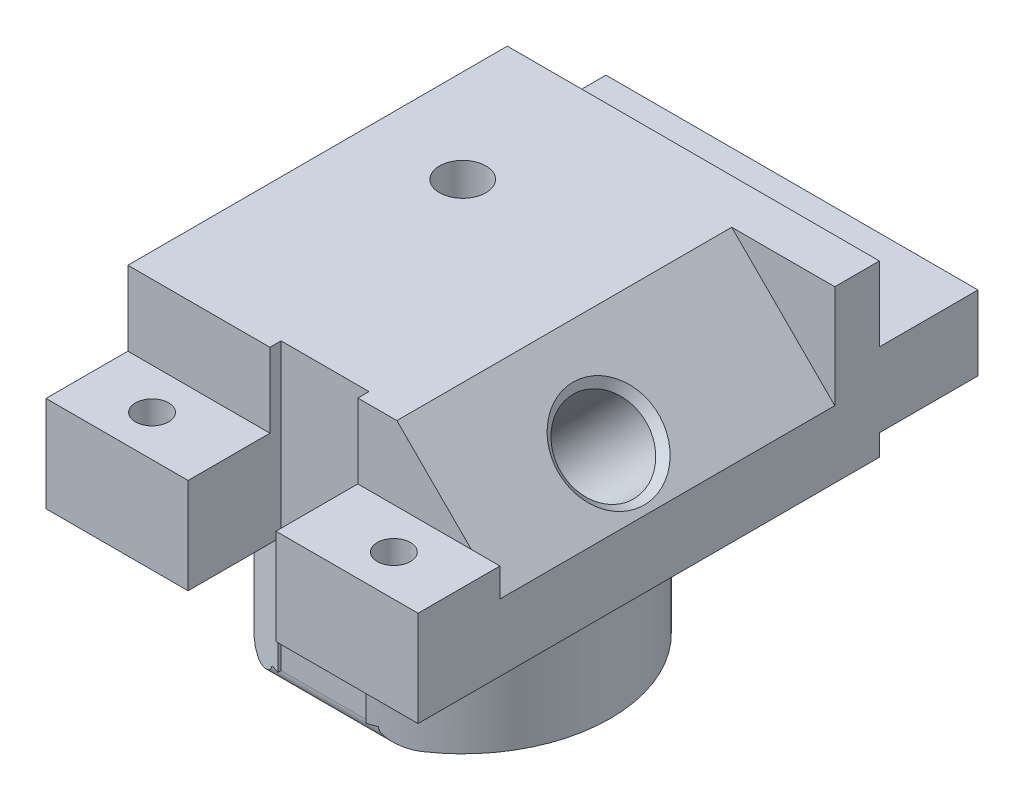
ISO-10303-21;
HEADER;
FILE_DESCRIPTION(('STEP AP214'),'2;1');
FILE_NAME('part.step','',(''),(''),'','','');
FILE_SCHEMA(('AUTOMOTIVE_DESIGN { 1 0 10303 214 1 1 1 1 }'));
ENDSEC;
DATA;
#1=APPLICATION_CONTEXT('core data for automotive mechanical design processes');
#2=APPLICATION_PROTOCOL_DEFINITION('international standard','automotive_design',2000,#1);
#3=PRODUCT_CONTEXT('',#1,'mechanical');
#4=PRODUCT('Part','Part','',(#3));
#5=PRODUCT_RELATED_PRODUCT_CATEGORY('part','',(#4));
#6=PRODUCT_DEFINITION_FORMATION('','',#4);
#7=PRODUCT_DEFINITION_CONTEXT('part definition',#1,'design');
#8=PRODUCT_DEFINITION('design','',#6,#7);
#9=PRODUCT_DEFINITION_SHAPE('','',#8);
#10=(LENGTH_UNIT() NAMED_UNIT(*) SI_UNIT(.MILLI.,.METRE.));
#11=(NAMED_UNIT(*) PLANE_ANGLE_UNIT() SI_UNIT($,.RADIAN.));
#12=(NAMED_UNIT(*) SI_UNIT($,.STERADIAN.) SOLID_ANGLE_UNIT());
#13=UNCERTAINTY_MEASURE_WITH_UNIT(LENGTH_MEASURE(1.E-05),#10,'distance_accuracy_value','');
#14=(GEOMETRIC_REPRESENTATION_CONTEXT(3) GLOBAL_UNCERTAINTY_ASSIGNED_CONTEXT((#13)) GLOBAL_UNIT_ASSIGNED_CONTEXT((#10,
#11,#12)) REPRESENTATION_CONTEXT('',''));
#15=CARTESIAN_POINT('',(0.,0.,0.));
#16=DIRECTION('',(0.,0.,1.));
#17=DIRECTION('',(1.,0.,0.));
#18=AXIS2_PLACEMENT_3D('',#15,#16,#17);
#19=CARTESIAN_POINT('',(18.415,-8.89,-15.748));
#20=DIRECTION('',(0.,-1.,0.));
#21=DIRECTION('',(0.,0.,-1.));
#22=AXIS2_PLACEMENT_3D('',#19,#20,#21);
#23=PLANE('',#22);
#24=CARTESIAN_POINT('',(18.415,-8.89,-15.748));
#25=DIRECTION('',(0.,-1.,0.));
#26=DIRECTION('',(0.,0.,-1.));
#27=AXIS2_PLACEMENT_3D('',#24,#25,#26);
#28=CIRCLE('',#27,4.79296285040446);
#29=CARTESIAN_POINT('',(18.415,-8.89,-20.5409628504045));
#30=VERTEX_POINT('',#29);
#31=EDGE_CURVE('E282',#30,#30,#28,.F.);
#32=ORIENTED_EDGE('',*,*,#31,.T.);
#33=EDGE_LOOP('',(#32));
#34=FACE_BOUND('',#33,.T.);
#35=CARTESIAN_POINT('',(18.415,-8.89,-15.748));
#36=DIRECTION('',(0.,-1.,0.));
#37=DIRECTION('',(0.,0.,-1.));
#38=AXIS2_PLACEMENT_3D('',#35,#36,#37);
#39=CIRCLE('',#38,10.0756532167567);
#40=CARTESIAN_POINT('',(12.8479196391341,-8.89,-7.35));
#41=VERTEX_POINT('',#40);
#42=CARTESIAN_POINT('',(23.9820803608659,-8.89,-7.35));
#43=VERTEX_POINT('',#42);
#44=EDGE_CURVE('E216',#41,#43,#39,.T.);
#45=ORIENTED_EDGE('',*,*,#44,.T.);
#46=DIRECTION('',(1.,0.,0.));
#47=VECTOR('',#46,1.);
#48=CARTESIAN_POINT('',(18.415,-8.89,-7.35));
#49=LINE('',#48,#47);
#50=EDGE_CURVE('E11',#43,#41,#49,.F.);
#51=ORIENTED_EDGE('',*,*,#50,.T.);
#52=EDGE_LOOP('',(#45,#51));
#53=FACE_BOUND('',#52,.T.);
#54=ADVANCED_FACE('F36',(#34,#53),#23,.T.);
#55=CARTESIAN_POINT('',(18.415,-8.89,-15.748));
#56=DIRECTION('',(0.,1.,0.));
#57=DIRECTION('',(0.,0.,1.));
#58=AXIS2_PLACEMENT_3D('',#55,#56,#57);
#59=CYLINDRICAL_SURFACE('',#58,10.0756532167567);
#60=CARTESIAN_POINT('',(23.9820803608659,-8.89,-7.35));
#61=CARTESIAN_POINT('',(23.911809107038,-8.88996134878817,-7.30340908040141));
#62=CARTESIAN_POINT('',(23.840978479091,-8.88674534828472,-7.25773228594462));
#63=CARTESIAN_POINT('',(23.6985786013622,-8.87441441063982,-7.16839547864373));
#64=CARTESIAN_POINT('',(23.6270095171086,-8.86530076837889,-7.1247350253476));
#65=CARTESIAN_POINT('',(23.4830345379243,-8.84155614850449,-7.03933358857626));
#66=CARTESIAN_POINT('',(23.4106262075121,-8.82689114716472,-6.99760626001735));
#67=CARTESIAN_POINT('',(23.2657885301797,-8.79222779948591,-6.91649202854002));
#68=CARTESIAN_POINT('',(23.1933591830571,-8.77222939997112,-6.87710514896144));
#69=CARTESIAN_POINT('',(23.024338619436,-8.71916397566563,-6.7878255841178));
#70=CARTESIAN_POINT('',(22.9278817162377,-8.68396495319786,-6.73889880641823));
#71=CARTESIAN_POINT('',(22.7849979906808,-8.62310618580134,-6.66919384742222));
#72=CARTESIAN_POINT('',(22.7377096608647,-8.60149826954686,-6.64659065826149));
#73=CARTESIAN_POINT('',(22.644033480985,-8.55523974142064,-6.60268798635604));
#74=CARTESIAN_POINT('',(22.5976452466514,-8.53059046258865,-6.58138793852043));
#75=CARTESIAN_POINT('',(22.5050406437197,-8.47700916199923,-6.53968836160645));
#76=CARTESIAN_POINT('',(22.4588622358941,-8.44798002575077,-6.51932829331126));
#77=CARTESIAN_POINT('',(22.3689964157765,-8.3852628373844,-6.48047187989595));
#78=CARTESIAN_POINT('',(22.3253041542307,-8.35158432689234,-6.4619718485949));
#79=CARTESIAN_POINT('',(22.2544209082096,-8.28875774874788,-6.43249384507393));
#80=CARTESIAN_POINT('',(22.226133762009,-8.26115303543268,-6.42089566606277));
#81=CARTESIAN_POINT('',(22.1731308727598,-8.2020503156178,-6.39941468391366));
#82=CARTESIAN_POINT('',(22.1484081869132,-8.17056010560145,-6.38952853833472));
#83=CARTESIAN_POINT('',(22.113626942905,-8.11642297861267,-6.37574577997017));
#84=CARTESIAN_POINT('',(22.1016453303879,-8.09523519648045,-6.37103024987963));
#85=CARTESIAN_POINT('',(22.0807261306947,-8.05124168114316,-6.36283274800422));
#86=CARTESIAN_POINT('',(22.0717761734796,-8.02844299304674,-6.35934576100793));
#87=CARTESIAN_POINT('',(22.0592921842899,-7.98648982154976,-6.35449374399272));
#88=CARTESIAN_POINT('',(22.0550100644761,-7.96759555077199,-6.35283472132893));
#89=CARTESIAN_POINT('',(22.0491723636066,-7.92915402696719,-6.35057575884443));
#90=CARTESIAN_POINT('',(22.0476426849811,-7.90960231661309,-6.34998588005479));
#91=CARTESIAN_POINT('',(22.047682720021,-7.89,-6.35));
#92=B_SPLINE_CURVE_WITH_KNOTS('',3,(#60,#61,#62,#63,#64,#65,#66,#67,#68,#69,#70,#71,#72,#73,#74,
#75,#76,#77,#78,#79,#80,#81,#82,#83,#84,#85,#86,#87,#88,#89,#90,#91),.UNSPECIFIED.,.F.,.F.,(4,2,
2,2,2,2,2,2,2,2,2,2,2,2,2,4),(0.,0.252818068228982,0.505580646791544,0.759918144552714,
1.01425817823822,1.35483512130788,1.5248357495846,1.69476212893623,1.86924489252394,
2.04337475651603,2.16671995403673,2.28982155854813,2.36400020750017,2.43787243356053,
2.495984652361,2.55464094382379),.UNSPECIFIED.);
#93=CARTESIAN_POINT('',(22.047682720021,-7.89,-6.35));
#94=VERTEX_POINT('',#93);
#95=EDGE_CURVE('E208',#43,#94,#92,.T.);
#96=ORIENTED_EDGE('',*,*,#95,.F.);
#97=ORIENTED_EDGE('',*,*,#44,.F.);
#98=CARTESIAN_POINT('',(14.782317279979,-7.89,-6.35));
#99=CARTESIAN_POINT('',(14.7823892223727,-7.91340389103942,-6.34997465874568));
#100=CARTESIAN_POINT('',(14.7801948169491,-7.93669717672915,-6.35082025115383));
#101=CARTESIAN_POINT('',(14.7719670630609,-7.98215863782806,-6.35400567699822));
#102=CARTESIAN_POINT('',(14.7659894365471,-8.00433818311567,-6.35632382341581));
#103=CARTESIAN_POINT('',(14.7487302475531,-8.05341384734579,-6.36304637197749));
#104=CARTESIAN_POINT('',(14.7364309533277,-8.07988668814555,-6.36785369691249));
#105=CARTESIAN_POINT('',(14.7081073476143,-8.13053076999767,-6.37901014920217));
#106=CARTESIAN_POINT('',(14.6920600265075,-8.15468643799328,-6.38536881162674));
#107=CARTESIAN_POINT('',(14.6439671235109,-8.21871950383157,-6.40459693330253));
#108=CARTESIAN_POINT('',(14.6092075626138,-8.25615995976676,-6.41867564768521));
#109=CARTESIAN_POINT('',(14.5355697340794,-8.32557611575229,-6.44905274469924));
#110=CARTESIAN_POINT('',(14.4966819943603,-8.35753878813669,-6.46535625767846));
#111=CARTESIAN_POINT('',(14.411429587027,-8.42105773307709,-6.50177802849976));
#112=CARTESIAN_POINT('',(14.3647422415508,-8.45204803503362,-6.52211784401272));
#113=CARTESIAN_POINT('',(14.2695708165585,-8.50987956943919,-6.56448600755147));
#114=CARTESIAN_POINT('',(14.2210847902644,-8.53671613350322,-6.58651621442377));
#115=CARTESIAN_POINT('',(14.1228449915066,-8.58700359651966,-6.63212721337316));
#116=CARTESIAN_POINT('',(14.0730872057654,-8.61044165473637,-6.65571342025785));
#117=CARTESIAN_POINT('',(13.9729100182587,-8.65423201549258,-6.7042328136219));
#118=CARTESIAN_POINT('',(13.9224908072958,-8.67458518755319,-6.72916561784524));
#119=CARTESIAN_POINT('',(13.7860190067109,-8.7256646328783,-6.79810837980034));
#120=CARTESIAN_POINT('',(13.6995780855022,-8.75375709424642,-6.84332333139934));
#121=CARTESIAN_POINT('',(13.5264065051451,-8.8023528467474,-6.93720210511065));
#122=CARTESIAN_POINT('',(13.4396757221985,-8.82285231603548,-6.98586764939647));
#123=CARTESIAN_POINT('',(13.2681419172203,-8.85579636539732,-7.08553540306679));
#124=CARTESIAN_POINT('',(13.1833323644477,-8.86837970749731,-7.13647955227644));
#125=CARTESIAN_POINT('',(13.056877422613,-8.8812022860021,-7.21501839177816));
#126=CARTESIAN_POINT('',(13.0148600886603,-8.88446769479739,-7.24154663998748));
#127=CARTESIAN_POINT('',(12.9311366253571,-8.88886465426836,-7.29527816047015));
#128=CARTESIAN_POINT('',(12.8894305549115,-8.88999581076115,-7.32248155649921));
#129=CARTESIAN_POINT('',(12.8479196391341,-8.89,-7.35));
#130=B_SPLINE_CURVE_WITH_KNOTS('',3,(#98,#99,#100,#101,#102,#103,#104,#105,#106,#107,#108,#109,
#110,#111,#112,#113,#114,#115,#116,#117,#118,#119,#120,#121,#122,#123,#124,#125,#126,#127,#128,
#129),.UNSPECIFIED.,.F.,.F.,(4,2,2,2,2,2,2,2,2,2,2,2,2,2,2,4),(0.,0.0699163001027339,
0.138826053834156,0.227075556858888,0.315881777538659,0.473971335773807,0.632431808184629,
0.8109950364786,0.989757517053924,1.1691787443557,1.34854930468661,1.65270270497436,
1.95700898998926,2.25582046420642,2.40517062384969,2.55454836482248),.UNSPECIFIED.);
#131=CARTESIAN_POINT('',(14.782317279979,-7.89,-6.35));
#132=VERTEX_POINT('',#131);
#133=EDGE_CURVE('E210',#132,#41,#130,.T.);
#134=ORIENTED_EDGE('',*,*,#133,.F.);
#135=CARTESIAN_POINT('',(18.415,-7.8899999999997,-15.748));
#136=DIRECTION('',(0.,-1.,0.));
#137=DIRECTION('',(0.,0.,-1.));
#138=AXIS2_PLACEMENT_3D('',#135,#136,#137);
#139=CIRCLE('',#138,10.0756532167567);
#140=CARTESIAN_POINT('',(15.415,-7.89000000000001,-6.12933129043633));
#141=VERTEX_POINT('',#140);
#142=EDGE_CURVE('E218',#141,#132,#139,.T.);
#143=ORIENTED_EDGE('',*,*,#142,.F.);
#144=DIRECTION('',(0.,1.,0.));
#145=VECTOR('',#144,1.);
#146=CARTESIAN_POINT('',(15.415,-8.89,-6.12933129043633));
#147=LINE('',#146,#145);
#148=CARTESIAN_POINT('',(15.415,0.,-6.12933129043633));
#149=VERTEX_POINT('',#148);
#150=EDGE_CURVE('E331',#141,#149,#147,.T.);
#151=ORIENTED_EDGE('',*,*,#150,.T.);
#152=CARTESIAN_POINT('',(18.415,0.,-15.748));
#153=DIRECTION('',(0.,-1.,0.));
#154=DIRECTION('',(0.,0.,-1.));
#155=AXIS2_PLACEMENT_3D('',#152,#153,#154);
#156=CIRCLE('',#155,10.0756532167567);
#157=CARTESIAN_POINT('',(21.415,0.,-6.12933129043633));
#158=VERTEX_POINT('',#157);
#159=EDGE_CURVE('E221',#149,#158,#156,.T.);
#160=ORIENTED_EDGE('',*,*,#159,.T.);
#161=DIRECTION('',(0.,1.,0.));
#162=VECTOR('',#161,1.);
#163=CARTESIAN_POINT('',(21.415,-8.89,-6.12933129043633));
#164=LINE('',#163,#162);
#165=CARTESIAN_POINT('',(21.415,-7.89000000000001,-6.12933129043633));
#166=VERTEX_POINT('',#165);
#167=EDGE_CURVE('E321',#158,#166,#164,.F.);
#168=ORIENTED_EDGE('',*,*,#167,.T.);
#169=EDGE_CURVE('E51',#94,#166,#139,.T.);
#170=ORIENTED_EDGE('',*,*,#169,.F.);
#171=EDGE_LOOP('',(#96,#97,#134,#143,#151,#160,#168,#170));
#172=FACE_BOUND('',#171,.T.);
#173=ADVANCED_FACE('F215',(#172),#59,.T.);
#174=CARTESIAN_POINT('',(15.415,11.605,-6.35));
#175=DIRECTION('',(-1.,0.,0.));
#176=DIRECTION('',(0.,-1.,0.));
#177=AXIS2_PLACEMENT_3D('',#174,#175,#176);
#178=PLANE('',#177);
#179=DIRECTION('',(0.,0.,1.));
#180=VECTOR('',#179,1.);
#181=CARTESIAN_POINT('',(15.415,-7.89,-6.35000000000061));
#182=LINE('',#181,#180);
#183=CARTESIAN_POINT('',(15.415,-7.89,-6.35));
#184=VERTEX_POINT('',#183);
#185=EDGE_CURVE('E640',#184,#141,#182,.T.);
#186=ORIENTED_EDGE('',*,*,#185,.F.);
#187=DIRECTION('',(0.,-1.,0.));
#188=VECTOR('',#187,1.);
#189=CARTESIAN_POINT('',(15.415,11.605,-6.35));
#190=LINE('',#189,#188);
#191=CARTESIAN_POINT('',(15.415,11.605,-6.35));
#192=VERTEX_POINT('',#191);
#193=EDGE_CURVE('E295',#192,#184,#190,.T.);
#194=ORIENTED_EDGE('',*,*,#193,.F.);
#195=DIRECTION('',(0.,0.,1.));
#196=VECTOR('',#195,1.);
#197=CARTESIAN_POINT('',(15.415,11.605,-6.35));
#198=LINE('',#197,#196);
#199=CARTESIAN_POINT('',(15.415,11.605,-5.588));
#200=VERTEX_POINT('',#199);
#201=EDGE_CURVE('E312',#192,#200,#198,.T.);
#202=ORIENTED_EDGE('',*,*,#201,.T.);
#203=DIRECTION('',(0.,1.,0.));
#204=VECTOR('',#203,1.);
#205=CARTESIAN_POINT('',(15.415,6.525,-5.588));
#206=LINE('',#205,#204);
#207=CARTESIAN_POINT('',(15.415,6.525,-5.588));
#208=VERTEX_POINT('',#207);
#209=EDGE_CURVE('E328',#208,#200,#206,.T.);
#210=ORIENTED_EDGE('',*,*,#209,.F.);
#211=DIRECTION('',(0.,0.,-1.));
#212=VECTOR('',#211,1.);
#213=CARTESIAN_POINT('',(15.415,6.525,0.));
#214=LINE('',#213,#212);
#215=CARTESIAN_POINT('',(15.415,6.525,0.));
#216=VERTEX_POINT('',#215);
#217=EDGE_CURVE('E325',#216,#208,#214,.T.);
#218=ORIENTED_EDGE('',*,*,#217,.F.);
#219=DIRECTION('',(0.,-1.,0.));
#220=VECTOR('',#219,1.);
#221=CARTESIAN_POINT('',(15.415,11.605,0.));
#222=LINE('',#221,#220);
#223=CARTESIAN_POINT('',(15.415,0.,0.));
#224=VERTEX_POINT('',#223);
#225=EDGE_CURVE('E309',#216,#224,#222,.T.);
#226=ORIENTED_EDGE('',*,*,#225,.T.);
#227=DIRECTION('',(0.,0.,-1.));
#228=VECTOR('',#227,1.);
#229=CARTESIAN_POINT('',(15.415,0.,0.));
#230=LINE('',#229,#228);
#231=EDGE_CURVE('E333',#224,#149,#230,.T.);
#232=ORIENTED_EDGE('',*,*,#231,.T.);
#233=ORIENTED_EDGE('',*,*,#150,.F.);
#234=EDGE_LOOP('',(#186,#194,#202,#210,#218,#226,#232,#233));
#235=FACE_BOUND('',#234,.T.);
#236=ADVANCED_FACE('F524',(#235),#178,.F.);
#237=CARTESIAN_POINT('',(21.415,11.605,-6.35));
#238=DIRECTION('',(1.,0.,0.));
#239=DIRECTION('',(0.,1.,0.));
#240=AXIS2_PLACEMENT_3D('',#237,#238,#239);
#241=PLANE('',#240);
#242=DIRECTION('',(0.,0.,-1.));
#243=VECTOR('',#242,1.);
#244=CARTESIAN_POINT('',(21.415,-7.89,-6.35000000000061));
#245=LINE('',#244,#243);
#246=CARTESIAN_POINT('',(21.415,-7.89,-6.35));
#247=VERTEX_POINT('',#246);
#248=EDGE_CURVE('E298',#166,#247,#245,.T.);
#249=ORIENTED_EDGE('',*,*,#248,.F.);
#250=ORIENTED_EDGE('',*,*,#167,.F.);
#251=DIRECTION('',(0.,0.,1.));
#252=VECTOR('',#251,1.);
#253=CARTESIAN_POINT('',(21.415,0.,0.));
#254=LINE('',#253,#252);
#255=CARTESIAN_POINT('',(21.415,0.,0.));
#256=VERTEX_POINT('',#255);
#257=EDGE_CURVE('E323',#158,#256,#254,.T.);
#258=ORIENTED_EDGE('',*,*,#257,.T.);
#259=DIRECTION('',(0.,1.,0.));
#260=VECTOR('',#259,1.);
#261=CARTESIAN_POINT('',(21.415,11.605,0.));
#262=LINE('',#261,#260);
#263=CARTESIAN_POINT('',(21.415,6.525,0.));
#264=VERTEX_POINT('',#263);
#265=EDGE_CURVE('E305',#256,#264,#262,.T.);
#266=ORIENTED_EDGE('',*,*,#265,.T.);
#267=DIRECTION('',(0.,0.,1.));
#268=VECTOR('',#267,1.);
#269=CARTESIAN_POINT('',(21.415,6.525,0.));
#270=LINE('',#269,#268);
#271=CARTESIAN_POINT('',(21.415,6.525,-5.588));
#272=VERTEX_POINT('',#271);
#273=EDGE_CURVE('E314',#272,#264,#270,.T.);
#274=ORIENTED_EDGE('',*,*,#273,.F.);
#275=DIRECTION('',(0.,-1.,0.));
#276=VECTOR('',#275,1.);
#277=CARTESIAN_POINT('',(21.415,6.525,-5.588));
#278=LINE('',#277,#276);
#279=CARTESIAN_POINT('',(21.415,11.605,-5.588));
#280=VERTEX_POINT('',#279);
#281=EDGE_CURVE('E318',#280,#272,#278,.T.);
#282=ORIENTED_EDGE('',*,*,#281,.F.);
#283=DIRECTION('',(0.,0.,1.));
#284=VECTOR('',#283,1.);
#285=CARTESIAN_POINT('',(21.415,11.605,-6.35));
#286=LINE('',#285,#284);
#287=CARTESIAN_POINT('',(21.415,11.605,-6.35));
#288=VERTEX_POINT('',#287);
#289=EDGE_CURVE('E300',#288,#280,#286,.T.);
#290=ORIENTED_EDGE('',*,*,#289,.F.);
#291=DIRECTION('',(0.,1.,0.));
#292=VECTOR('',#291,1.);
#293=CARTESIAN_POINT('',(21.415,11.605,-6.35));
#294=LINE('',#293,#292);
#295=EDGE_CURVE('E293',#247,#288,#294,.T.);
#296=ORIENTED_EDGE('',*,*,#295,.F.);
#297=EDGE_LOOP('',(#249,#250,#258,#266,#274,#282,#290,#296));
#298=FACE_BOUND('',#297,.T.);
#299=ADVANCED_FACE('F297',(#298),#241,.F.);
#300=CARTESIAN_POINT('',(0.,12.7,0.));
#301=DIRECTION('',(0.,0.,-1.));
#302=DIRECTION('',(-1.,0.,0.));
#303=AXIS2_PLACEMENT_3D('',#300,#301,#302);
#304=PLANE('',#303);
#305=DIRECTION('',(1.,0.,0.));
#306=VECTOR('',#305,1.);
#307=CARTESIAN_POINT('',(0.,0.,0.));
#308=LINE('',#307,#306);
#309=CARTESIAN_POINT('',(5.715,0.,0.));
#310=VERTEX_POINT('',#309);
#311=EDGE_CURVE('E223',#310,#224,#308,.T.);
#312=ORIENTED_EDGE('',*,*,#311,.T.);
#313=ORIENTED_EDGE('',*,*,#225,.F.);
#314=DIRECTION('',(1.,0.,0.));
#315=VECTOR('',#314,1.);
#316=CARTESIAN_POINT('',(0.,6.525,0.));
#317=LINE('',#316,#315);
#318=CARTESIAN_POINT('',(5.715,6.525,0.));
#319=VERTEX_POINT('',#318);
#320=EDGE_CURVE('E484',#319,#216,#317,.T.);
#321=ORIENTED_EDGE('',*,*,#320,.F.);
#322=DIRECTION('',(0.,1.,0.));
#323=VECTOR('',#322,1.);
#324=CARTESIAN_POINT('',(5.715,0.,0.));
#325=LINE('',#324,#323);
#326=EDGE_CURVE('E406',#310,#319,#325,.T.);
#327=ORIENTED_EDGE('',*,*,#326,.F.);
#328=EDGE_LOOP('',(#312,#313,#321,#327));
#329=FACE_BOUND('',#328,.T.);
#330=ADVANCED_FACE('F516',(#329),#304,.F.);
#331=CARTESIAN_POINT('',(0.,6.525,-5.588));
#332=DIRECTION('',(0.,0.,-1.));
#333=DIRECTION('',(-1.,0.,0.));
#334=AXIS2_PLACEMENT_3D('',#331,#332,#333);
#335=PLANE('',#334);
#336=DIRECTION('',(-1.,0.,0.));
#337=VECTOR('',#336,1.);
#338=CARTESIAN_POINT('',(0.,6.525,-5.588));
#339=LINE('',#338,#337);
#340=CARTESIAN_POINT('',(5.715,6.525,-5.588));
#341=VERTEX_POINT('',#340);
#342=EDGE_CURVE('E487',#208,#341,#339,.T.);
#343=ORIENTED_EDGE('',*,*,#342,.F.);
#344=ORIENTED_EDGE('',*,*,#209,.T.);
#345=DIRECTION('',(-1.,0.,0.));
#346=VECTOR('',#345,1.);
#347=CARTESIAN_POINT('',(36.83105,11.605,-5.588));
#348=LINE('',#347,#346);
#349=CARTESIAN_POINT('',(5.715,11.605,-5.588));
#350=VERTEX_POINT('',#349);
#351=EDGE_CURVE('E418',#200,#350,#348,.T.);
#352=ORIENTED_EDGE('',*,*,#351,.T.);
#353=DIRECTION('',(0.,1.,0.));
#354=VECTOR('',#353,1.);
#355=CARTESIAN_POINT('',(5.715,0.,-5.588));
#356=LINE('',#355,#354);
#357=EDGE_CURVE('E394',#341,#350,#356,.T.);
#358=ORIENTED_EDGE('',*,*,#357,.F.);
#359=EDGE_LOOP('',(#343,#344,#352,#358));
#360=FACE_BOUND('',#359,.T.);
#361=ADVANCED_FACE('F535',(#360),#335,.F.);
#362=CARTESIAN_POINT('',(0.,6.525,0.));
#363=DIRECTION('',(0.,-1.,0.));
#364=DIRECTION('',(0.,0.,-1.));
#365=AXIS2_PLACEMENT_3D('',#362,#363,#364);
#366=PLANE('',#365);
#367=CARTESIAN_POINT('',(10.16,6.525,-2.794));
#368=DIRECTION('',(0.,1.,0.));
#369=DIRECTION('',(0.,0.,1.));
#370=AXIS2_PLACEMENT_3D('',#367,#368,#369);
#371=CIRCLE('',#370,1.13029999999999);
#372=CARTESIAN_POINT('',(10.16,6.525,-1.66370000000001));
#373=VERTEX_POINT('',#372);
#374=EDGE_CURVE('E471',#373,#373,#371,.T.);
#375=ORIENTED_EDGE('',*,*,#374,.F.);
#376=EDGE_LOOP('',(#375));
#377=FACE_BOUND('',#376,.T.);
#378=ORIENTED_EDGE('',*,*,#320,.T.);
#379=ORIENTED_EDGE('',*,*,#217,.T.);
#380=ORIENTED_EDGE('',*,*,#342,.T.);
#381=DIRECTION('',(0.,0.,-1.));
#382=VECTOR('',#381,1.);
#383=CARTESIAN_POINT('',(5.715,6.525,-38.228025));
#384=LINE('',#383,#382);
#385=EDGE_CURVE('E389',#319,#341,#384,.T.);
#386=ORIENTED_EDGE('',*,*,#385,.F.);
#387=EDGE_LOOP('',(#378,#379,#380,#386));
#388=FACE_BOUND('',#387,.T.);
#389=ADVANCED_FACE('F528',(#377,#388),#366,.F.);
#390=CARTESIAN_POINT('',(18.415,-8.89,-15.748));
#391=DIRECTION('',(0.,-1.,0.));
#392=DIRECTION('',(0.,0.,-1.));
#393=AXIS2_PLACEMENT_3D('',#390,#391,#392);
#394=CIRCLE('',#393,3.08103714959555);
#395=CARTESIAN_POINT('',(18.415,-8.89,-18.8290371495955));
#396=VERTEX_POINT('',#395);
#397=EDGE_CURVE('E279',#396,#396,#394,.T.);
#398=ORIENTED_EDGE('',*,*,#397,.T.);
#399=EDGE_LOOP('',(#398));
#400=FACE_BOUND('',#399,.T.);
#401=CARTESIAN_POINT('',(18.415,-8.89,-15.748));
#402=DIRECTION('',(0.,-1.,0.));
#403=DIRECTION('',(0.,0.,-1.));
#404=AXIS2_PLACEMENT_3D('',#401,#402,#403);
#405=CIRCLE('',#404,1.64047755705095);
#406=CARTESIAN_POINT('',(18.415,-8.89,-17.388477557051));
#407=VERTEX_POINT('',#406);
#408=EDGE_CURVE('E493',#407,#407,#405,.T.);
#409=ORIENTED_EDGE('',*,*,#408,.F.);
#410=EDGE_LOOP('',(#409));
#411=FACE_BOUND('',#410,.T.);
#412=ADVANCED_FACE('F520',(#400,#411),#23,.T.);
#413=CARTESIAN_POINT('',(18.4968719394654,-2.56643540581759,-15.748));
#414=DIRECTION('',(0.707106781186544,0.707106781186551,0.));
#415=DIRECTION('',(-0.707106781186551,0.707106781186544,0.));
#416=AXIS2_PLACEMENT_3D('',#413,#414,#415);
#417=CONICAL_SURFACE('',#416,0.992251,1.02974425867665);
#418=CARTESIAN_POINT('',(18.4968719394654,-2.56643540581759,-15.748));
#419=DIRECTION('',(0.707106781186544,0.707106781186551,0.));
#420=DIRECTION('',(-0.707106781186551,0.707106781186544,0.));
#421=AXIS2_PLACEMENT_3D('',#418,#419,#420);
#422=CIRCLE('',#421,0.992251);
#423=CARTESIAN_POINT('',(18.6945282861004,-2.76409175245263,-16.7000640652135));
#424=VERTEX_POINT('',#423);
#425=CARTESIAN_POINT('',(18.4629594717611,-2.53252293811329,-16.7390912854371));
#426=VERTEX_POINT('',#425);
#427=EDGE_CURVE('E458',#424,#426,#422,.T.);
#428=ORIENTED_EDGE('',*,*,#427,.T.);
#429=CARTESIAN_POINT('',(18.1106666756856,-2.0572,-16.6924274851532));
#430=CARTESIAN_POINT('',(18.1367758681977,-2.10068585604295,-16.7008271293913));
#431=CARTESIAN_POINT('',(18.1639897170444,-2.14369945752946,-16.7084134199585));
#432=CARTESIAN_POINT('',(18.2207308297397,-2.22861046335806,-16.7214879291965));
#433=CARTESIAN_POINT('',(18.2502621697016,-2.27050571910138,-16.7269723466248));
#434=CARTESIAN_POINT('',(18.3118638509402,-2.35313852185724,-16.7353673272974));
#435=CARTESIAN_POINT('',(18.3439505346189,-2.39386589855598,-16.7382595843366));
#436=CARTESIAN_POINT('',(18.4102540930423,-2.47360022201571,-16.7407944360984));
#437=CARTESIAN_POINT('',(18.4444693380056,-2.51260844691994,-16.7404394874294));
#438=CARTESIAN_POINT('',(18.5352166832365,-2.6110527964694,-16.7345148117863));
#439=CARTESIAN_POINT('',(18.5931107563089,-2.66911232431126,-16.7260202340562));
#440=CARTESIAN_POINT('',(18.7107313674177,-2.77994956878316,-16.6970817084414));
#441=CARTESIAN_POINT('',(18.7704521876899,-2.83274192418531,-16.6766720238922));
#442=CARTESIAN_POINT('',(18.8783815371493,-2.92397570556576,-16.6270564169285));
#443=CARTESIAN_POINT('',(18.9267994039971,-2.96332199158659,-16.5999742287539));
#444=CARTESIAN_POINT('',(19.0205646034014,-3.03746275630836,-16.5360702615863));
#445=CARTESIAN_POINT('',(19.0659185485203,-3.07226719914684,-16.49927035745));
#446=CARTESIAN_POINT('',(19.1243919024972,-3.11628433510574,-16.442132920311));
#447=CARTESIAN_POINT('',(19.1398864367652,-3.12785603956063,-16.4259477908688));
#448=CARTESIAN_POINT('',(19.1699874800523,-3.15018847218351,-16.3922554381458));
#449=CARTESIAN_POINT('',(19.1845941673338,-3.16094936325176,-16.3747484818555));
#450=CARTESIAN_POINT('',(19.1986993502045,-3.17128237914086,-16.3565863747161));
#451=B_SPLINE_CURVE_WITH_KNOTS('',3,(#429,#430,#431,#432,#433,#434,#435,#436,#437,#438,#439,
#440,#441,#442,#443,#444,#445,#446,#447,#448,#449,#450),.UNSPECIFIED.,.F.,.F.,(4,2,2,2,2,2,2,2,
2,2,4),(0.,0.154260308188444,0.308798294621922,0.464419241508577,0.619922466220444,
0.866255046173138,1.11188273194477,1.31515410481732,1.51797175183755,1.59357355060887,
1.66916011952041),.UNSPECIFIED.);
#452=EDGE_CURVE('E246',#426,#424,#451,.T.);
#453=ORIENTED_EDGE('',*,*,#452,.T.);
#454=EDGE_LOOP('',(#428,#453));
#455=FACE_BOUND('',#454,.T.);
#456=ADVANCED_FACE('F527',(#455),#417,.F.);
#457=CARTESIAN_POINT('',(0.,0.,0.));
#458=DIRECTION('',(0.,-1.,0.));
#459=DIRECTION('',(0.,0.,-1.));
#460=AXIS2_PLACEMENT_3D('',#457,#458,#459);
#461=PLANE('',#460);
#462=ORIENTED_EDGE('',*,*,#231,.F.);
#463=ORIENTED_EDGE('',*,*,#311,.F.);
#464=DIRECTION('',(0.,0.,1.));
#465=VECTOR('',#464,1.);
#466=CARTESIAN_POINT('',(5.715,0.,-38.228025));
#467=LINE('',#466,#465);
#468=CARTESIAN_POINT('',(5.715,0.,-31.496));
#469=VERTEX_POINT('',#468);
#470=EDGE_CURVE('E409',#469,#310,#467,.T.);
#471=ORIENTED_EDGE('',*,*,#470,.F.);
#472=DIRECTION('',(-1.,0.,0.));
#473=VECTOR('',#472,1.);
#474=CARTESIAN_POINT('',(31.115,0.,-31.496));
#475=LINE('',#474,#473);
#476=CARTESIAN_POINT('',(31.115,0.,-31.496));
#477=VERTEX_POINT('',#476);
#478=EDGE_CURVE('E354',#477,#469,#475,.T.);
#479=ORIENTED_EDGE('',*,*,#478,.F.);
#480=DIRECTION('',(0.,0.,1.));
#481=VECTOR('',#480,1.);
#482=CARTESIAN_POINT('',(31.115,0.,-38.228025));
#483=LINE('',#482,#481);
#484=CARTESIAN_POINT('',(31.115,0.,0.));
#485=VERTEX_POINT('',#484);
#486=EDGE_CURVE('E386',#477,#485,#483,.T.);
#487=ORIENTED_EDGE('',*,*,#486,.T.);
#488=EDGE_CURVE('E220',#256,#485,#308,.T.);
#489=ORIENTED_EDGE('',*,*,#488,.F.);
#490=ORIENTED_EDGE('',*,*,#257,.F.);
#491=ORIENTED_EDGE('',*,*,#159,.F.);
#492=EDGE_LOOP('',(#462,#463,#471,#479,#487,#489,#490,#491));
#493=FACE_BOUND('',#492,.T.);
#494=CARTESIAN_POINT('',(10.16,0.,-2.794));
#495=DIRECTION('',(0.,-1.,0.));
#496=DIRECTION('',(0.,0.,-1.));
#497=AXIS2_PLACEMENT_3D('',#494,#495,#496);
#498=CIRCLE('',#497,1.13029999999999);
#499=CARTESIAN_POINT('',(10.16,0.,-3.92429999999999));
#500=VERTEX_POINT('',#499);
#501=EDGE_CURVE('E474',#500,#500,#498,.T.);
#502=ORIENTED_EDGE('',*,*,#501,.F.);
#503=EDGE_LOOP('',(#502));
#504=FACE_BOUND('',#503,.T.);
#505=CARTESIAN_POINT('',(26.67,0.,-2.794));
#506=DIRECTION('',(0.,-1.,0.));
#507=DIRECTION('',(0.,0.,-1.));
#508=AXIS2_PLACEMENT_3D('',#505,#506,#507);
#509=CIRCLE('',#508,1.13029999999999);
#510=CARTESIAN_POINT('',(26.67,0.,-3.92429999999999));
#511=VERTEX_POINT('',#510);
#512=EDGE_CURVE('E480',#511,#511,#509,.T.);
#513=ORIENTED_EDGE('',*,*,#512,.F.);
#514=EDGE_LOOP('',(#513));
#515=FACE_BOUND('',#514,.T.);
#516=ADVANCED_FACE('F513',(#493,#504,#515),#461,.T.);
#517=CARTESIAN_POINT('',(31.115,6.525,0.));
#518=VERTEX_POINT('',#517);
#519=EDGE_CURVE('E483',#264,#518,#317,.T.);
#520=ORIENTED_EDGE('',*,*,#519,.F.);
#521=ORIENTED_EDGE('',*,*,#265,.F.);
#522=ORIENTED_EDGE('',*,*,#488,.T.);
#523=DIRECTION('',(0.,-1.,0.));
#524=VECTOR('',#523,1.);
#525=CARTESIAN_POINT('',(31.115,0.,0.));
#526=LINE('',#525,#524);
#527=EDGE_CURVE('E383',#518,#485,#526,.T.);
#528=ORIENTED_EDGE('',*,*,#527,.F.);
#529=EDGE_LOOP('',(#520,#521,#522,#528));
#530=FACE_BOUND('',#529,.T.);
#531=ADVANCED_FACE('F504',(#530),#304,.F.);
#532=CARTESIAN_POINT('',(18.415,-8.89,-15.748));
#533=DIRECTION('',(0.,1.,0.));
#534=DIRECTION('',(0.,0.,-1.));
#535=AXIS2_PLACEMENT_3D('',#532,#533,#534);
#536=CONICAL_SURFACE('',#535,1.64047755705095,0.0698131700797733);
#537=CARTESIAN_POINT('',(18.415,-13.6144,-15.748));
#538=DIRECTION('',(0.,-1.,0.));
#539=DIRECTION('',(0.,0.,-1.));
#540=AXIS2_PLACEMENT_3D('',#537,#538,#539);
#541=CIRCLE('',#540,1.31011532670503);
#542=CARTESIAN_POINT('',(18.415,-13.6144,-17.058115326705));
#543=VERTEX_POINT('',#542);
#544=EDGE_CURVE('E226',#543,#543,#541,.T.);
#545=ORIENTED_EDGE('',*,*,#544,.F.);
#546=EDGE_LOOP('',(#545));
#547=FACE_BOUND('',#546,.T.);
#548=ORIENTED_EDGE('',*,*,#408,.T.);
#549=EDGE_LOOP('',(#548));
#550=FACE_BOUND('',#549,.T.);
#551=ADVANCED_FACE('F502',(#547,#550),#536,.T.);
#552=CARTESIAN_POINT('',(18.415,-13.6144,-15.748));
#553=DIRECTION('',(0.,-1.,0.));
#554=DIRECTION('',(0.,0.,-1.));
#555=AXIS2_PLACEMENT_3D('',#552,#553,#554);
#556=PLANE('',#555);
#557=CARTESIAN_POINT('',(18.415,-13.6144,-15.748));
#558=DIRECTION('',(0.,-1.,0.));
#559=DIRECTION('',(0.,0.,-1.));
#560=AXIS2_PLACEMENT_3D('',#557,#558,#559);
#561=CIRCLE('',#560,0.992251);
#562=CARTESIAN_POINT('',(18.415,-13.6144,-16.740251));
#563=VERTEX_POINT('',#562);
#564=EDGE_CURVE('E442',#563,#563,#561,.T.);
#565=ORIENTED_EDGE('',*,*,#564,.F.);
#566=EDGE_LOOP('',(#565));
#567=FACE_BOUND('',#566,.T.);
#568=ORIENTED_EDGE('',*,*,#544,.T.);
#569=EDGE_LOOP('',(#568));
#570=FACE_BOUND('',#569,.T.);
#571=ADVANCED_FACE('F500',(#567,#570),#556,.T.);
#572=CARTESIAN_POINT('',(36.83,6.525,-31.496));
#573=DIRECTION('',(0.,0.,1.));
#574=DIRECTION('',(1.,0.,0.));
#575=AXIS2_PLACEMENT_3D('',#572,#573,#574);
#576=PLANE('',#575);
#577=DIRECTION('',(-1.,0.,0.));
#578=VECTOR('',#577,1.);
#579=CARTESIAN_POINT('',(36.83105,11.605,-31.496));
#580=LINE('',#579,#578);
#581=CARTESIAN_POINT('',(31.115,11.605,-31.496));
#582=VERTEX_POINT('',#581);
#583=CARTESIAN_POINT('',(5.715,11.605,-31.496));
#584=VERTEX_POINT('',#583);
#585=EDGE_CURVE('E411',#582,#584,#580,.T.);
#586=ORIENTED_EDGE('',*,*,#585,.F.);
#587=DIRECTION('',(0.,1.,0.));
#588=VECTOR('',#587,1.);
#589=CARTESIAN_POINT('',(31.115,0.,-31.496));
#590=LINE('',#589,#588);
#591=CARTESIAN_POINT('',(31.115,6.525,-31.496));
#592=VERTEX_POINT('',#591);
#593=EDGE_CURVE('E381',#592,#582,#590,.T.);
#594=ORIENTED_EDGE('',*,*,#593,.F.);
#595=DIRECTION('',(1.,0.,0.));
#596=VECTOR('',#595,1.);
#597=CARTESIAN_POINT('',(36.83,6.525,-31.496));
#598=LINE('',#597,#596);
#599=CARTESIAN_POINT('',(5.715,6.525,-31.496));
#600=VERTEX_POINT('',#599);
#601=EDGE_CURVE('E490',#600,#592,#598,.T.);
#602=ORIENTED_EDGE('',*,*,#601,.F.);
#603=DIRECTION('',(0.,-1.,0.));
#604=VECTOR('',#603,1.);
#605=CARTESIAN_POINT('',(5.715,0.,-31.496));
#606=LINE('',#605,#604);
#607=EDGE_CURVE('E397',#584,#600,#606,.T.);
#608=ORIENTED_EDGE('',*,*,#607,.F.);
#609=EDGE_LOOP('',(#586,#594,#602,#608));
#610=FACE_BOUND('',#609,.T.);
#611=ADVANCED_FACE('F510',(#610),#576,.F.);
#612=CARTESIAN_POINT('',(0.,6.525,0.));
#613=DIRECTION('',(0.,-1.,0.));
#614=DIRECTION('',(0.,0.,-1.));
#615=AXIS2_PLACEMENT_3D('',#612,#613,#614);
#616=PLANE('',#615);
#617=CARTESIAN_POINT('',(25.4,6.525,-34.8615));
#618=DIRECTION('',(0.,-1.,0.));
#619=DIRECTION('',(0.,0.,-1.));
#620=AXIS2_PLACEMENT_3D('',#617,#618,#619);
#621=CIRCLE('',#620,1.47319999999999);
#622=CARTESIAN_POINT('',(25.4,6.525,-36.3347));
#623=VERTEX_POINT('',#622);
#624=EDGE_CURVE('E425',#623,#623,#621,.T.);
#625=ORIENTED_EDGE('',*,*,#624,.T.);
#626=EDGE_LOOP('',(#625));
#627=FACE_BOUND('',#626,.T.);
#628=CARTESIAN_POINT('',(11.43,6.525,-34.8615));
#629=DIRECTION('',(0.,-1.,0.));
#630=DIRECTION('',(0.,0.,-1.));
#631=AXIS2_PLACEMENT_3D('',#628,#629,#630);
#632=CIRCLE('',#631,1.47319999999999);
#633=CARTESIAN_POINT('',(11.43,6.525,-36.3347));
#634=VERTEX_POINT('',#633);
#635=EDGE_CURVE('E431',#634,#634,#632,.T.);
#636=ORIENTED_EDGE('',*,*,#635,.T.);
#637=EDGE_LOOP('',(#636));
#638=FACE_BOUND('',#637,.T.);
#639=ORIENTED_EDGE('',*,*,#601,.T.);
#640=DIRECTION('',(0.,0.,1.));
#641=VECTOR('',#640,1.);
#642=CARTESIAN_POINT('',(31.115,6.525,-38.228025));
#643=LINE('',#642,#641);
#644=CARTESIAN_POINT('',(31.115,6.525,-38.227));
#645=VERTEX_POINT('',#644);
#646=EDGE_CURVE('E379',#645,#592,#643,.T.);
#647=ORIENTED_EDGE('',*,*,#646,.F.);
#648=DIRECTION('',(1.,0.,0.));
#649=VECTOR('',#648,1.);
#650=CARTESIAN_POINT('',(36.83,6.525,-38.227));
#651=LINE('',#650,#649);
#652=CARTESIAN_POINT('',(5.715,6.525,-38.227));
#653=VERTEX_POINT('',#652);
#654=EDGE_CURVE('E439',#653,#645,#651,.T.);
#655=ORIENTED_EDGE('',*,*,#654,.F.);
#656=DIRECTION('',(0.,0.,-1.));
#657=VECTOR('',#656,1.);
#658=CARTESIAN_POINT('',(5.715,6.525,-38.228025));
#659=LINE('',#658,#657);
#660=EDGE_CURVE('E404',#600,#653,#659,.T.);
#661=ORIENTED_EDGE('',*,*,#660,.F.);
#662=EDGE_LOOP('',(#639,#647,#655,#661));
#663=FACE_BOUND('',#662,.T.);
#664=ADVANCED_FACE('F621',(#627,#638,#663),#616,.F.);
#665=CARTESIAN_POINT('',(24.0819999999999,11.605,-5.588));
#666=VERTEX_POINT('',#665);
#667=EDGE_CURVE('E414',#666,#280,#348,.T.);
#668=ORIENTED_EDGE('',*,*,#667,.T.);
#669=ORIENTED_EDGE('',*,*,#281,.T.);
#670=CARTESIAN_POINT('',(29.1619999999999,6.525,-5.588));
#671=VERTEX_POINT('',#670);
#672=EDGE_CURVE('E491',#671,#272,#339,.T.);
#673=ORIENTED_EDGE('',*,*,#672,.F.);
#674=DIRECTION('',(-0.707106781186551,0.707106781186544,0.));
#675=VECTOR('',#674,1.);
#676=CARTESIAN_POINT('',(22.9869999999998,12.7,-5.588));
#677=LINE('',#676,#675);
#678=EDGE_CURVE('E466',#671,#666,#677,.T.);
#679=ORIENTED_EDGE('',*,*,#678,.T.);
#680=EDGE_LOOP('',(#668,#669,#673,#679));
#681=FACE_BOUND('',#680,.T.);
#682=ADVANCED_FACE('F712',(#681),#335,.F.);
#683=CARTESIAN_POINT('',(26.67,6.525,-2.794));
#684=DIRECTION('',(0.,1.,0.));
#685=DIRECTION('',(0.,0.,1.));
#686=AXIS2_PLACEMENT_3D('',#683,#684,#685);
#687=CIRCLE('',#686,1.13029999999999);
#688=CARTESIAN_POINT('',(26.67,6.525,-1.66370000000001));
#689=VERTEX_POINT('',#688);
#690=EDGE_CURVE('E477',#689,#689,#687,.T.);
#691=ORIENTED_EDGE('',*,*,#690,.F.);
#692=EDGE_LOOP('',(#691));
#693=FACE_BOUND('',#692,.T.);
#694=ORIENTED_EDGE('',*,*,#672,.T.);
#695=ORIENTED_EDGE('',*,*,#273,.T.);
#696=ORIENTED_EDGE('',*,*,#519,.T.);
#697=DIRECTION('',(0.,0.,1.));
#698=VECTOR('',#697,1.);
#699=CARTESIAN_POINT('',(31.115,6.525,-38.228025));
#700=LINE('',#699,#698);
#701=CARTESIAN_POINT('',(31.115,6.525,-5.588));
#702=VERTEX_POINT('',#701);
#703=EDGE_CURVE('E359',#702,#518,#700,.T.);
#704=ORIENTED_EDGE('',*,*,#703,.F.);
#705=EDGE_CURVE('E488',#702,#671,#339,.T.);
#706=ORIENTED_EDGE('',*,*,#705,.T.);
#707=EDGE_LOOP('',(#694,#695,#696,#704,#706));
#708=FACE_BOUND('',#707,.T.);
#709=ADVANCED_FACE('F538',(#693,#708),#366,.F.);
#710=CARTESIAN_POINT('',(26.67,6.525,-2.794));
#711=DIRECTION('',(0.,1.,0.));
#712=DIRECTION('',(0.,0.,1.));
#713=AXIS2_PLACEMENT_3D('',#710,#711,#712);
#714=CYLINDRICAL_SURFACE('',#713,1.13029999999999);
#715=ORIENTED_EDGE('',*,*,#690,.T.);
#716=EDGE_LOOP('',(#715));
#717=FACE_BOUND('',#716,.T.);
#718=ORIENTED_EDGE('',*,*,#512,.T.);
#719=EDGE_LOOP('',(#718));
#720=FACE_BOUND('',#719,.T.);
#721=ADVANCED_FACE('F700',(#717,#720),#714,.F.);
#722=CARTESIAN_POINT('',(10.16,6.525,-2.794));
#723=DIRECTION('',(0.,1.,0.));
#724=DIRECTION('',(0.,0.,1.));
#725=AXIS2_PLACEMENT_3D('',#722,#723,#724);
#726=CYLINDRICAL_SURFACE('',#725,1.13029999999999);
#727=ORIENTED_EDGE('',*,*,#374,.T.);
#728=EDGE_LOOP('',(#727));
#729=FACE_BOUND('',#728,.T.);
#730=ORIENTED_EDGE('',*,*,#501,.T.);
#731=EDGE_LOOP('',(#730));
#732=FACE_BOUND('',#731,.T.);
#733=ADVANCED_FACE('F702',(#729,#732),#726,.F.);
#734=CARTESIAN_POINT('',(0.,0.,-5.588));
#735=DIRECTION('',(0.,0.,1.));
#736=DIRECTION('',(1.,0.,0.));
#737=AXIS2_PLACEMENT_3D('',#734,#735,#736);
#738=PLANE('',#737);
#739=ORIENTED_EDGE('',*,*,#705,.F.);
#740=DIRECTION('',(0.,1.,0.));
#741=VECTOR('',#740,1.);
#742=CARTESIAN_POINT('',(31.115,0.,-5.588));
#743=LINE('',#742,#741);
#744=CARTESIAN_POINT('',(31.115,4.57199999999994,-5.588));
#745=VERTEX_POINT('',#744);
#746=EDGE_CURVE('E372',#745,#702,#743,.T.);
#747=ORIENTED_EDGE('',*,*,#746,.F.);
#748=EDGE_CURVE('E469',#745,#671,#677,.T.);
#749=ORIENTED_EDGE('',*,*,#748,.T.);
#750=EDGE_LOOP('',(#739,#747,#749));
#751=FACE_BOUND('',#750,.T.);
#752=ADVANCED_FACE('F709',(#751),#738,.F.);
#753=CARTESIAN_POINT('',(22.9869999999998,12.7,-5.588));
#754=DIRECTION('',(-0.707106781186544,-0.707106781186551,0.));
#755=DIRECTION('',(0.707106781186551,-0.707106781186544,0.));
#756=AXIS2_PLACEMENT_3D('',#753,#754,#755);
#757=PLANE('',#756);
#758=CARTESIAN_POINT('',(28.3751536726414,7.31184632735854,-15.748));
#759=DIRECTION('',(-0.707106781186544,-0.707106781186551,0.));
#760=DIRECTION('',(0.707106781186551,-0.707106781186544,0.));
#761=AXIS2_PLACEMENT_3D('',#758,#759,#760);
#762=CIRCLE('',#761,3.42900000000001);
#763=CARTESIAN_POINT('',(25.9504845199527,9.7365154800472,-15.748));
#764=VERTEX_POINT('',#763);
#765=EDGE_CURVE('E235',#764,#764,#762,.T.);
#766=ORIENTED_EDGE('',*,*,#765,.T.);
#767=EDGE_LOOP('',(#766));
#768=FACE_BOUND('',#767,.T.);
#769=ORIENTED_EDGE('',*,*,#748,.F.);
#770=DIRECTION('',(0.,0.,1.));
#771=VECTOR('',#770,1.);
#772=CARTESIAN_POINT('',(31.115,4.57199999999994,-38.228025));
#773=LINE('',#772,#771);
#774=CARTESIAN_POINT('',(31.115,4.57199999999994,-28.448));
#775=VERTEX_POINT('',#774);
#776=EDGE_CURVE('E370',#775,#745,#773,.T.);
#777=ORIENTED_EDGE('',*,*,#776,.F.);
#778=DIRECTION('',(-0.707106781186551,0.707106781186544,0.));
#779=VECTOR('',#778,1.);
#780=CARTESIAN_POINT('',(22.9869999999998,12.7,-28.448));
#781=LINE('',#780,#779);
#782=CARTESIAN_POINT('',(24.0819999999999,11.605,-28.448));
#783=VERTEX_POINT('',#782);
#784=EDGE_CURVE('E465',#775,#783,#781,.T.);
#785=ORIENTED_EDGE('',*,*,#784,.T.);
#786=DIRECTION('',(0.,0.,-1.));
#787=VECTOR('',#786,1.);
#788=CARTESIAN_POINT('',(24.0819999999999,11.605,-31.496));
#789=LINE('',#788,#787);
#790=EDGE_CURVE('E422',#666,#783,#789,.T.);
#791=ORIENTED_EDGE('',*,*,#790,.F.);
#792=ORIENTED_EDGE('',*,*,#678,.F.);
#793=EDGE_LOOP('',(#769,#777,#785,#791,#792));
#794=FACE_BOUND('',#793,.T.);
#795=ADVANCED_FACE('F827',(#768,#794),#757,.F.);
#796=CARTESIAN_POINT('',(0.,0.,-28.448));
#797=DIRECTION('',(0.,0.,1.));
#798=DIRECTION('',(1.,0.,0.));
#799=AXIS2_PLACEMENT_3D('',#796,#797,#798);
#800=PLANE('',#799);
#801=DIRECTION('',(0.,1.,0.));
#802=VECTOR('',#801,1.);
#803=CARTESIAN_POINT('',(31.115,0.,-28.448));
#804=LINE('',#803,#802);
#805=CARTESIAN_POINT('',(31.115,11.605,-28.448));
#806=VERTEX_POINT('',#805);
#807=EDGE_CURVE('E367',#775,#806,#804,.T.);
#808=ORIENTED_EDGE('',*,*,#807,.T.);
#809=DIRECTION('',(-1.,0.,0.));
#810=VECTOR('',#809,1.);
#811=CARTESIAN_POINT('',(36.83105,11.605,-28.448));
#812=LINE('',#811,#810);
#813=EDGE_CURVE('E417',#806,#783,#812,.T.);
#814=ORIENTED_EDGE('',*,*,#813,.T.);
#815=ORIENTED_EDGE('',*,*,#784,.F.);
#816=EDGE_LOOP('',(#808,#814,#815));
#817=FACE_BOUND('',#816,.T.);
#818=ADVANCED_FACE('F1014',(#817),#800,.T.);
#819=CARTESIAN_POINT('',(22.088974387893,1.0256670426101,-15.748));
#820=DIRECTION('',(0.707106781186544,0.707106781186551,0.));
#821=DIRECTION('',(-0.707106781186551,0.707106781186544,0.));
#822=AXIS2_PLACEMENT_3D('',#819,#820,#821);
#823=CYLINDRICAL_SURFACE('',#822,2.921);
#824=CARTESIAN_POINT('',(28.0159434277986,6.95263608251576,-15.748));
#825=DIRECTION('',(-0.707106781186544,-0.707106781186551,0.));
#826=DIRECTION('',(0.707106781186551,-0.707106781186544,0.));
#827=AXIS2_PLACEMENT_3D('',#824,#825,#826);
#828=CIRCLE('',#827,2.921);
#829=CARTESIAN_POINT('',(25.9504845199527,9.01809499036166,-15.748));
#830=VERTEX_POINT('',#829);
#831=EDGE_CURVE('E232',#830,#830,#828,.F.);
#832=CARTESIAN_POINT('',(22.088974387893,1.0256670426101,-15.748));
#833=DIRECTION('',(0.707106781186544,0.707106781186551,0.));
#834=DIRECTION('',(-0.707106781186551,0.707106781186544,0.));
#835=AXIS2_PLACEMENT_3D('',#832,#833,#834);
#836=CIRCLE('',#835,2.921);
#837=CARTESIAN_POINT('',(20.0235154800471,3.09112595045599,-15.748));
#838=VERTEX_POINT('',#837);
#839=EDGE_CURVE('E462',#838,#838,#836,.T.);
#840=CARTESIAN_POINT('',(25.9504845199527,9.01809499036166,-15.748));
#841=CARTESIAN_POINT('',(25.8887452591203,8.95635572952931,-15.748));
#842=CARTESIAN_POINT('',(25.827005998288,8.89461646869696,-15.748));
#843=CARTESIAN_POINT('',(25.7035274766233,8.77113794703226,-15.748));
#844=CARTESIAN_POINT('',(25.6417882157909,8.70939868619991,-15.748));
#845=CARTESIAN_POINT('',(25.5183096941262,8.5859201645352,-15.748));
#846=CARTESIAN_POINT('',(25.4565704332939,8.52418090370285,-15.748));
#847=CARTESIAN_POINT('',(25.3330919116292,8.40070238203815,-15.748));
#848=CARTESIAN_POINT('',(25.2713526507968,8.3389631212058,-15.748));
#849=CARTESIAN_POINT('',(25.1478741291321,8.2154845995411,-15.748));
#850=CARTESIAN_POINT('',(25.0861348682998,8.15374533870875,-15.748));
#851=CARTESIAN_POINT('',(24.9626563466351,8.03026681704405,-15.748));
#852=CARTESIAN_POINT('',(24.9009170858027,7.9685275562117,-15.748));
#853=CARTESIAN_POINT('',(24.777438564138,7.845049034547,-15.748));
#854=CARTESIAN_POINT('',(24.7156993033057,7.78330977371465,-15.748));
#855=CARTESIAN_POINT('',(24.592220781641,7.65983125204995,-15.748));
#856=CARTESIAN_POINT('',(24.5304815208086,7.59809199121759,-15.748));
#857=CARTESIAN_POINT('',(24.4070029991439,7.47461346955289,-15.748));
#858=CARTESIAN_POINT('',(24.3452637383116,7.41287420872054,-15.748));
#859=CARTESIAN_POINT('',(24.2217852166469,7.28939568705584,-15.748));
#860=CARTESIAN_POINT('',(24.1600459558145,7.22765642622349,-15.748));
#861=CARTESIAN_POINT('',(24.0365674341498,7.10417790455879,-15.748));
#862=CARTESIAN_POINT('',(23.9748281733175,7.04243864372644,-15.748));
#863=CARTESIAN_POINT('',(23.8513496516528,6.91896012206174,-15.748));
#864=CARTESIAN_POINT('',(23.7896103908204,6.85722086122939,-15.748));
#865=CARTESIAN_POINT('',(23.6661318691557,6.73374233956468,-15.748));
#866=CARTESIAN_POINT('',(23.6043926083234,6.67200307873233,-15.748));
#867=CARTESIAN_POINT('',(23.4809140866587,6.54852455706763,-15.748));
#868=CARTESIAN_POINT('',(23.4191748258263,6.48678529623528,-15.748));
#869=CARTESIAN_POINT('',(23.2956963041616,6.36330677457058,-15.748));
#870=CARTESIAN_POINT('',(23.2339570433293,6.30156751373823,-15.748));
#871=CARTESIAN_POINT('',(23.1104785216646,6.17808899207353,-15.748));
#872=CARTESIAN_POINT('',(23.0487392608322,6.11634973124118,-15.748));
#873=CARTESIAN_POINT('',(22.9252607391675,5.99287120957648,-15.748));
#874=CARTESIAN_POINT('',(22.8635214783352,5.93113194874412,-15.748));
#875=CARTESIAN_POINT('',(22.7400429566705,5.80765342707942,-15.748));
#876=CARTESIAN_POINT('',(22.6783036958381,5.74591416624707,-15.748));
#877=CARTESIAN_POINT('',(22.5548251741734,5.62243564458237,-15.748));
#878=CARTESIAN_POINT('',(22.4930859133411,5.56069638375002,-15.748));
#879=CARTESIAN_POINT('',(22.3696073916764,5.43721786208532,-15.748));
#880=CARTESIAN_POINT('',(22.307868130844,5.37547860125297,-15.748));
#881=CARTESIAN_POINT('',(22.1843896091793,5.25200007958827,-15.748));
#882=CARTESIAN_POINT('',(22.122650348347,5.19026081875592,-15.748));
#883=CARTESIAN_POINT('',(21.9991718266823,5.06678229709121,-15.748));
#884=CARTESIAN_POINT('',(21.9374325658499,5.00504303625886,-15.748));
#885=CARTESIAN_POINT('',(21.8139540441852,4.88156451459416,-15.748));
#886=CARTESIAN_POINT('',(21.7522147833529,4.81982525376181,-15.748));
#887=CARTESIAN_POINT('',(21.6287362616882,4.69634673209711,-15.748));
#888=CARTESIAN_POINT('',(21.5669970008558,4.63460747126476,-15.748));
#889=CARTESIAN_POINT('',(21.4435184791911,4.51112894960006,-15.748));
#890=CARTESIAN_POINT('',(21.3817792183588,4.44938968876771,-15.748));
#891=CARTESIAN_POINT('',(21.2583006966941,4.32591116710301,-15.748));
#892=CARTESIAN_POINT('',(21.1965614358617,4.26417190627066,-15.748));
#893=CARTESIAN_POINT('',(21.073082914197,4.14069338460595,-15.748));
#894=CARTESIAN_POINT('',(21.0113436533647,4.0789541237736,-15.748));
#895=CARTESIAN_POINT('',(20.8878651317,3.9554756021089,-15.748));
#896=CARTESIAN_POINT('',(20.8261258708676,3.89373634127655,-15.748));
#897=CARTESIAN_POINT('',(20.7026473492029,3.77025781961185,-15.748));
#898=CARTESIAN_POINT('',(20.6409080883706,3.7085185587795,-15.748));
#899=CARTESIAN_POINT('',(20.5174295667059,3.5850400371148,-15.748));
#900=CARTESIAN_POINT('',(20.4556903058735,3.52330077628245,-15.748));
#901=CARTESIAN_POINT('',(20.3322117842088,3.39982225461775,-15.748));
#902=CARTESIAN_POINT('',(20.2704725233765,3.3380829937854,-15.748));
#903=CARTESIAN_POINT('',(20.1469940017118,3.21460447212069,-15.748));
#904=CARTESIAN_POINT('',(20.0852547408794,3.15286521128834,-15.748));
#905=CARTESIAN_POINT('',(20.0235154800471,3.09112595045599,-15.748));
#906=B_SPLINE_CURVE_WITH_KNOTS('',3,(#840,#841,#842,#843,#844,#845,#846,#847,#848,#849,#850,
#851,#852,#853,#854,#855,#856,#857,#858,#859,#860,#861,#862,#863,#864,#865,#866,#867,#868,#869,
#870,#871,#872,#873,#874,#875,#876,#877,#878,#879,#880,#881,#882,#883,#884,#885,#886,#887,#888,
#889,#890,#891,#892,#893,#894,#895,#896,#897,#898,#899,#900,#901,#902,#903,#904,#905),
.UNSPECIFIED.,.F.,.F.,(4,2,2,2,2,2,2,2,2,2,2,2,2,2,2,2,2,2,2,2,2,2,2,2,2,2,2,2,2,2,2,2,4),(0.,
0.2619375,0.523874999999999,0.785812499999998,1.04775,1.3096875,1.571625,1.8335625,2.0955,
2.3574375,2.619375,2.8813125,3.14325,3.4051875,3.66712499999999,3.9290625,4.191,4.4529375,
4.71487499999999,4.97681249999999,5.23875,5.50068749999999,5.76262499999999,6.0245625,
6.28649999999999,6.54843749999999,6.810375,7.07231249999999,7.33424999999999,7.59618749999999,
7.85812499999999,8.12006249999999,8.38199999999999),.UNSPECIFIED.);
#907=EDGE_CURVE('BSEAM1007',#830,#838,#906,.T.);
#908=ORIENTED_EDGE('',*,*,#831,.T.);
#909=ORIENTED_EDGE('',*,*,#839,.F.);
#910=ORIENTED_EDGE('',*,*,#907,.T.);
#911=ORIENTED_EDGE('',*,*,#907,.F.);
#912=EDGE_LOOP('',(#908,#910,#909,#911));
#913=FACE_BOUND('',#912,.T.);
#914=ADVANCED_FACE('F1007',(#913),#823,.F.);
#915=CARTESIAN_POINT('',(22.088974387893,1.0256670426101,-15.748));
#916=DIRECTION('',(0.707106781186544,0.707106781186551,0.));
#917=DIRECTION('',(-0.707106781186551,0.707106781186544,0.));
#918=AXIS2_PLACEMENT_3D('',#915,#916,#917);
#919=PLANE('',#918);
#920=CARTESIAN_POINT('',(22.088974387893,1.0256670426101,-15.748));
#921=DIRECTION('',(0.707106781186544,0.707106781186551,0.));
#922=DIRECTION('',(-0.707106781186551,0.707106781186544,0.));
#923=AXIS2_PLACEMENT_3D('',#920,#921,#922);
#924=CIRCLE('',#923,0.992251);
#925=CARTESIAN_POINT('',(21.3873469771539,1.72729445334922,-15.748));
#926=VERTEX_POINT('',#925);
#927=EDGE_CURVE('E455',#926,#926,#924,.T.);
#928=ORIENTED_EDGE('',*,*,#927,.F.);
#929=EDGE_LOOP('',(#928));
#930=FACE_BOUND('',#929,.T.);
#931=ORIENTED_EDGE('',*,*,#839,.T.);
#932=EDGE_LOOP('',(#931));
#933=FACE_BOUND('',#932,.T.);
#934=ADVANCED_FACE('F686',(#930,#933),#919,.T.);
#935=CARTESIAN_POINT('',(28.0159434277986,6.95263608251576,-15.748));
#936=DIRECTION('',(0.707106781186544,0.707106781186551,0.));
#937=DIRECTION('',(-0.707106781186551,0.707106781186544,0.));
#938=AXIS2_PLACEMENT_3D('',#935,#936,#937);
#939=CONICAL_SURFACE('',#938,2.921,0.78539816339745);
#940=CARTESIAN_POINT('',(25.9504845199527,9.7365154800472,-15.748));
#941=CARTESIAN_POINT('',(25.9504845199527,9.72903193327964,-15.748));
#942=CARTESIAN_POINT('',(25.9504845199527,9.72154838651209,-15.748));
#943=CARTESIAN_POINT('',(25.9504845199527,9.70658129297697,-15.748));
#944=CARTESIAN_POINT('',(25.9504845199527,9.69909774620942,-15.748));
#945=CARTESIAN_POINT('',(25.9504845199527,9.6841306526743,-15.748));
#946=CARTESIAN_POINT('',(25.9504845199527,9.67664710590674,-15.748));
#947=CARTESIAN_POINT('',(25.9504845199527,9.66168001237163,-15.748));
#948=CARTESIAN_POINT('',(25.9504845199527,9.65419646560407,-15.748));
#949=CARTESIAN_POINT('',(25.9504845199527,9.63922937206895,-15.748));
#950=CARTESIAN_POINT('',(25.9504845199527,9.6317458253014,-15.748));
#951=CARTESIAN_POINT('',(25.9504845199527,9.61677873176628,-15.748));
#952=CARTESIAN_POINT('',(25.9504845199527,9.60929518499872,-15.748));
#953=CARTESIAN_POINT('',(25.9504845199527,9.59432809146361,-15.748));
#954=CARTESIAN_POINT('',(25.9504845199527,9.58684454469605,-15.748));
#955=CARTESIAN_POINT('',(25.9504845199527,9.57187745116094,-15.748));
#956=CARTESIAN_POINT('',(25.9504845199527,9.56439390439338,-15.748));
#957=CARTESIAN_POINT('',(25.9504845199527,9.54942681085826,-15.748));
#958=CARTESIAN_POINT('',(25.9504845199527,9.5419432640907,-15.748));
#959=CARTESIAN_POINT('',(25.9504845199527,9.52697617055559,-15.748));
#960=CARTESIAN_POINT('',(25.9504845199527,9.51949262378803,-15.748));
#961=CARTESIAN_POINT('',(25.9504845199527,9.50452553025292,-15.748));
#962=CARTESIAN_POINT('',(25.9504845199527,9.49704198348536,-15.748));
#963=CARTESIAN_POINT('',(25.9504845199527,9.48207488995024,-15.748));
#964=CARTESIAN_POINT('',(25.9504845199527,9.47459134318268,-15.748));
#965=CARTESIAN_POINT('',(25.9504845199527,9.45962424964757,-15.748));
#966=CARTESIAN_POINT('',(25.9504845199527,9.45214070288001,-15.748));
#967=CARTESIAN_POINT('',(25.9504845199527,9.4371736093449,-15.748));
#968=CARTESIAN_POINT('',(25.9504845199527,9.42969006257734,-15.748));
#969=CARTESIAN_POINT('',(25.9504845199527,9.41472296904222,-15.748));
#970=CARTESIAN_POINT('',(25.9504845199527,9.40723942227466,-15.748));
#971=CARTESIAN_POINT('',(25.9504845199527,9.39227232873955,-15.748));
#972=CARTESIAN_POINT('',(25.9504845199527,9.38478878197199,-15.748));
#973=CARTESIAN_POINT('',(25.9504845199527,9.36982168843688,-15.748));
#974=CARTESIAN_POINT('',(25.9504845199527,9.36233814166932,-15.748));
#975=CARTESIAN_POINT('',(25.9504845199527,9.3473710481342,-15.748));
#976=CARTESIAN_POINT('',(25.9504845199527,9.33988750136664,-15.748));
#977=CARTESIAN_POINT('',(25.9504845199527,9.32492040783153,-15.748));
#978=CARTESIAN_POINT('',(25.9504845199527,9.31743686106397,-15.748));
#979=CARTESIAN_POINT('',(25.9504845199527,9.30246976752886,-15.748));
#980=CARTESIAN_POINT('',(25.9504845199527,9.2949862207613,-15.748));
#981=CARTESIAN_POINT('',(25.9504845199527,9.28001912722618,-15.748));
#982=CARTESIAN_POINT('',(25.9504845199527,9.27253558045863,-15.748));
#983=CARTESIAN_POINT('',(25.9504845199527,9.25756848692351,-15.748));
#984=CARTESIAN_POINT('',(25.9504845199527,9.25008494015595,-15.748));
#985=CARTESIAN_POINT('',(25.9504845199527,9.23511784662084,-15.748));
#986=CARTESIAN_POINT('',(25.9504845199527,9.22763429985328,-15.748));
#987=CARTESIAN_POINT('',(25.9504845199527,9.21266720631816,-15.748));
#988=CARTESIAN_POINT('',(25.9504845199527,9.20518365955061,-15.748));
#989=CARTESIAN_POINT('',(25.9504845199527,9.19021656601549,-15.748));
#990=CARTESIAN_POINT('',(25.9504845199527,9.18273301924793,-15.748));
#991=CARTESIAN_POINT('',(25.9504845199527,9.16776592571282,-15.748));
#992=CARTESIAN_POINT('',(25.9504845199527,9.16028237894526,-15.748));
#993=CARTESIAN_POINT('',(25.9504845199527,9.14531528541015,-15.748));
#994=CARTESIAN_POINT('',(25.9504845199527,9.13783173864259,-15.748));
#995=CARTESIAN_POINT('',(25.9504845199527,9.12286464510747,-15.748));
#996=CARTESIAN_POINT('',(25.9504845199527,9.11538109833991,-15.748));
#997=CARTESIAN_POINT('',(25.9504845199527,9.1004140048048,-15.748));
#998=CARTESIAN_POINT('',(25.9504845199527,9.09293045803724,-15.748));
#999=CARTESIAN_POINT('',(25.9504845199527,9.07796336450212,-15.748));
#1000=CARTESIAN_POINT('',(25.9504845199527,9.07047981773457,-15.748));
#1001=CARTESIAN_POINT('',(25.9504845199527,9.05551272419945,-15.748));
#1002=CARTESIAN_POINT('',(25.9504845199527,9.04802917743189,-15.748));
#1003=CARTESIAN_POINT('',(25.9504845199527,9.03306208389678,-15.748));
#1004=CARTESIAN_POINT('',(25.9504845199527,9.02557853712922,-15.748));
#1005=CARTESIAN_POINT('',(25.9504845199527,9.01809499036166,-15.748));
#1006=B_SPLINE_CURVE_WITH_KNOTS('',3,(#940,#941,#942,#943,#944,#945,#946,#947,#948,#949,#950,
#951,#952,#953,#954,#955,#956,#957,#958,#959,#960,#961,#962,#963,#964,#965,#966,#967,#968,#969,
#970,#971,#972,#973,#974,#975,#976,#977,#978,#979,#980,#981,#982,#983,#984,#985,#986,#987,#988,
#989,#990,#991,#992,#993,#994,#995,#996,#997,#998,#999,#1000,#1001,#1002,#1003,#1004,#1005),
.UNSPECIFIED.,.F.,.F.,(4,2,2,2,2,2,2,2,2,2,2,2,2,2,2,2,2,2,2,2,2,2,2,2,2,2,2,2,2,2,2,2,4),(0.,
0.0224506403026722,0.0449012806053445,0.0673519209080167,0.0898025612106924,0.112253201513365,
0.134703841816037,0.157154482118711,0.179605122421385,0.202055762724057,0.224506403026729,
0.246957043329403,0.269407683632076,0.29185832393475,0.314308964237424,0.336759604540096,
0.35921024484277,0.381660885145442,0.404111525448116,0.426562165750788,0.44901280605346,
0.471463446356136,0.493914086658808,0.516364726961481,0.538815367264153,0.561266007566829,
0.583716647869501,0.606167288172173,0.628617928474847,0.651068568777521,0.673519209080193,
0.695969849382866,0.71842048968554),.UNSPECIFIED.);
#1007=EDGE_CURVE('BSEAM684',#764,#830,#1006,.T.);
#1008=ORIENTED_EDGE('',*,*,#765,.F.);
#1009=ORIENTED_EDGE('',*,*,#831,.F.);
#1010=ORIENTED_EDGE('',*,*,#1007,.T.);
#1011=ORIENTED_EDGE('',*,*,#1007,.F.);
#1012=EDGE_LOOP('',(#1008,#1010,#1009,#1011));
#1013=FACE_BOUND('',#1012,.T.);
#1014=ADVANCED_FACE('F684',(#1013),#939,.F.);
#1015=CARTESIAN_POINT('',(18.462959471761,-2.53252293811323,-14.7569087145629));
#1016=VERTEX_POINT('',#1015);
#1017=CARTESIAN_POINT('',(18.6945282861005,-2.76409175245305,-14.7959359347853));
#1018=VERTEX_POINT('',#1017);
#1019=EDGE_CURVE('E459',#1016,#1018,#422,.T.);
#1020=ORIENTED_EDGE('',*,*,#1019,.T.);
#1021=CARTESIAN_POINT('',(19.1986993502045,-3.17128237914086,-15.1394136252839));
#1022=CARTESIAN_POINT('',(19.1636415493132,-3.14558579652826,-15.0942357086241));
#1023=CARTESIAN_POINT('',(19.1255191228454,-3.11729648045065,-15.0532204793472));
#1024=CARTESIAN_POINT('',(19.0452871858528,-3.05643979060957,-14.9797392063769));
#1025=CARTESIAN_POINT('',(19.003205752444,-3.02390198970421,-14.9472183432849));
#1026=CARTESIAN_POINT('',(18.9062197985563,-2.94677507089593,-14.8834745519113));
#1027=CARTESIAN_POINT('',(18.8506756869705,-2.90117465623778,-14.8544683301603));
#1028=CARTESIAN_POINT('',(18.7389107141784,-2.80491485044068,-14.8081531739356));
#1029=CARTESIAN_POINT('',(18.6826884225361,-2.75424202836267,-14.7908762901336));
#1030=CARTESIAN_POINT('',(18.5920285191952,-2.66730020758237,-14.7709897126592));
#1031=CARTESIAN_POINT('',(18.5569609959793,-2.6323255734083,-14.7653480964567));
#1032=CARTESIAN_POINT('',(18.4882366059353,-2.56060452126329,-14.7578523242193));
#1033=CARTESIAN_POINT('',(18.4545801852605,-2.52385755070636,-14.7559993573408));
#1034=CARTESIAN_POINT('',(18.3891093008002,-2.44871968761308,-14.7555458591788));
#1035=CARTESIAN_POINT('',(18.3572958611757,-2.41032790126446,-14.7569471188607));
#1036=CARTESIAN_POINT('',(18.2957711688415,-2.33207923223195,-14.7624540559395));
#1037=CARTESIAN_POINT('',(18.2660602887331,-2.29222209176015,-14.7665602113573));
#1038=CARTESIAN_POINT('',(18.2149575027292,-2.21994773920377,-14.7758538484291));
#1039=CARTESIAN_POINT('',(18.1931479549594,-2.18776800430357,-14.7806206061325));
#1040=CARTESIAN_POINT('',(18.1509110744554,-2.12288098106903,-14.7912927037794));
#1041=CARTESIAN_POINT('',(18.1304786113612,-2.09017628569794,-14.7971934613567));
#1042=CARTESIAN_POINT('',(18.1106666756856,-2.0572,-14.8035725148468));
#1043=B_SPLINE_CURVE_WITH_KNOTS('',3,(#1021,#1022,#1023,#1024,#1025,#1026,#1027,#1028,#1029,
#1030,#1031,#1032,#1033,#1034,#1035,#1036,#1037,#1038,#1039,#1040,#1041,#1042),.UNSPECIFIED.,
.F.,.F.,(4,2,2,2,2,2,2,2,2,2,4),(0.,0.187488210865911,0.373734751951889,0.605031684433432,
0.836958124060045,0.986318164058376,1.13572507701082,1.28521423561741,1.43472981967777,
1.55218197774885,1.66916914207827),.UNSPECIFIED.);
#1044=EDGE_CURVE('E238',#1018,#1016,#1043,.T.);
#1045=ORIENTED_EDGE('',*,*,#1044,.T.);
#1046=EDGE_LOOP('',(#1020,#1045));
#1047=FACE_BOUND('',#1046,.T.);
#1048=ADVANCED_FACE('F251',(#1047),#417,.F.);
#1049=CARTESIAN_POINT('',(22.088974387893,1.0256670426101,-15.748));
#1050=DIRECTION('',(0.707106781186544,0.707106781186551,0.));
#1051=DIRECTION('',(-0.707106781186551,0.707106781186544,0.));
#1052=AXIS2_PLACEMENT_3D('',#1049,#1050,#1051);
#1053=CYLINDRICAL_SURFACE('',#1052,0.992251);
#1054=ORIENTED_EDGE('',*,*,#427,.F.);
#1055=CARTESIAN_POINT('',(18.415,-2.64830734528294,-15.748));
#1056=DIRECTION('',(0.382683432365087,0.923879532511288,0.));
#1057=DIRECTION('',(0.923879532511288,-0.382683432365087,0.));
#1058=AXIS2_PLACEMENT_3D('',#1055,#1056,#1057);
#1059=ELLIPSE('',#1058,1.07400474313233,0.992250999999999);
#1060=EDGE_CURVE('E448',#424,#1018,#1059,.F.);
#1061=ORIENTED_EDGE('',*,*,#1060,.T.);
#1062=ORIENTED_EDGE('',*,*,#1019,.F.);
#1063=CARTESIAN_POINT('',(18.415,-2.64830734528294,-15.748));
#1064=DIRECTION('',(0.923879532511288,-0.382683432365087,0.));
#1065=DIRECTION('',(0.382683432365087,0.923879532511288,0.));
#1066=AXIS2_PLACEMENT_3D('',#1063,#1064,#1065);
#1067=ELLIPSE('',#1066,2.59287681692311,0.992250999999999);
#1068=CARTESIAN_POINT('',(18.6597618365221,-2.0574,-14.7864108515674));
#1069=VERTEX_POINT('',#1068);
#1070=EDGE_CURVE('E451',#1016,#1069,#1067,.F.);
#1071=ORIENTED_EDGE('',*,*,#1070,.T.);
#1072=CARTESIAN_POINT('',(18.6604694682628,-2.05759999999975,-14.7862477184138));
#1073=CARTESIAN_POINT('',(18.59604038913,-2.03937130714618,-14.801060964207));
#1074=CARTESIAN_POINT('',(18.532650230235,-2.02128850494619,-14.8213819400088));
#1075=CARTESIAN_POINT('',(18.4099203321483,-1.98567931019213,-14.8730926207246));
#1076=CARTESIAN_POINT('',(18.3506079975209,-1.96815703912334,-14.9045498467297));
#1077=CARTESIAN_POINT('',(18.2492916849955,-1.93734072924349,-14.9715071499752));
#1078=CARTESIAN_POINT('',(18.2061236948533,-1.92386805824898,-15.0051558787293));
#1079=CARTESIAN_POINT('',(18.1260002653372,-1.89785227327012,-15.0793425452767));
#1080=CARTESIAN_POINT('',(18.0890289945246,-1.88530683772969,-15.1198623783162));
#1081=CARTESIAN_POINT('',(18.0226751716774,-1.86128473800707,-15.207543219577));
#1082=CARTESIAN_POINT('',(17.9933515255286,-1.84981678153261,-15.2547516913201));
#1083=CARTESIAN_POINT('',(17.9442954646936,-1.82856742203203,-15.3542683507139));
#1084=CARTESIAN_POINT('',(17.9245597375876,-1.81878543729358,-15.4065747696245));
#1085=CARTESIAN_POINT('',(17.8966944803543,-1.80313699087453,-15.5081614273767));
#1086=CARTESIAN_POINT('',(17.8874996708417,-1.79695160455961,-15.5571085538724));
#1087=CARTESIAN_POINT('',(17.8757360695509,-1.78854616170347,-15.6561614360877));
#1088=CARTESIAN_POINT('',(17.8731750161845,-1.78633073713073,-15.7062684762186));
#1089=CARTESIAN_POINT('',(17.8738597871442,-1.78688315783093,-15.8101491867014));
#1090=CARTESIAN_POINT('',(17.8775507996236,-1.79003314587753,-15.8639189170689));
#1091=CARTESIAN_POINT('',(17.8929118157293,-1.80055804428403,-15.9698453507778));
#1092=CARTESIAN_POINT('',(17.9045708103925,-1.80792712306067,-16.0220041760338));
#1093=CARTESIAN_POINT('',(17.9368900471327,-1.82494179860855,-16.122795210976));
#1094=CARTESIAN_POINT('',(17.9575048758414,-1.83457579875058,-16.1714437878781));
#1095=CARTESIAN_POINT('',(18.0071104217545,-1.85525622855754,-16.2639402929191));
#1096=CARTESIAN_POINT('',(18.0361060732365,-1.86630348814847,-16.3077853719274));
#1097=CARTESIAN_POINT('',(18.0989695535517,-1.88868256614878,-16.3870363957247));
#1098=CARTESIAN_POINT('',(18.1324129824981,-1.89995214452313,-16.4228007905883));
#1099=CARTESIAN_POINT('',(18.204150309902,-1.92320842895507,-16.4887974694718));
#1100=CARTESIAN_POINT('',(18.2424464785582,-1.93519546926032,-16.5190271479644));
#1101=CARTESIAN_POINT('',(18.3282487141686,-1.96141095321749,-16.5774815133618));
#1102=CARTESIAN_POINT('',(18.376298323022,-1.97572194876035,-16.6048687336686));
#1103=CARTESIAN_POINT('',(18.4757524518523,-2.00485478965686,-16.6521101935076));
#1104=CARTESIAN_POINT('',(18.5271543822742,-2.01967623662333,-16.6719701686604));
#1105=CARTESIAN_POINT('',(18.6063270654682,-2.04226495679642,-16.6962742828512));
#1106=CARTESIAN_POINT('',(18.6332995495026,-2.04992010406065,-16.7034983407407));
#1107=CARTESIAN_POINT('',(18.6604694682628,-2.05759999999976,-16.7097522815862));
#1108=B_SPLINE_CURVE_WITH_KNOTS('',3,(#1072,#1073,#1074,#1075,#1076,#1077,#1078,#1079,#1080,
#1081,#1082,#1083,#1084,#1085,#1086,#1087,#1088,#1089,#1090,#1091,#1092,#1093,#1094,#1095,#1096,
#1097,#1098,#1099,#1100,#1101,#1102,#1103,#1104,#1105,#1106,#1107),.UNSPECIFIED.,.F.,.F.,(4,2,2,
2,2,2,2,2,2,2,2,2,2,2,2,2,2,4),(0.,0.205795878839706,0.412861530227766,0.581267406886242,
0.749236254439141,0.918463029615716,1.08763129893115,1.23754630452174,1.38763611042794,
1.54886785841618,1.7098772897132,1.87007963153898,2.03037648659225,2.18053014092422,
2.33075430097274,2.50149194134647,2.67209922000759,2.7588802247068),.UNSPECIFIED.);
#1109=CARTESIAN_POINT('',(18.6597618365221,-2.0574,-16.7095891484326));
#1110=VERTEX_POINT('',#1109);
#1111=EDGE_CURVE('E270',#1069,#1110,#1108,.T.);
#1112=ORIENTED_EDGE('',*,*,#1111,.T.);
#1113=EDGE_CURVE('E454',#1110,#426,#1067,.F.);
#1114=ORIENTED_EDGE('',*,*,#1113,.T.);
#1115=EDGE_LOOP('',(#1054,#1061,#1062,#1071,#1112,#1114));
#1116=FACE_BOUND('',#1115,.T.);
#1117=ORIENTED_EDGE('',*,*,#927,.T.);
#1118=EDGE_LOOP('',(#1117));
#1119=FACE_BOUND('',#1118,.T.);
#1120=ADVANCED_FACE('F267',(#1116,#1119),#1053,.F.);
#1121=CARTESIAN_POINT('',(18.415,-2.0574,-15.748));
#1122=DIRECTION('',(0.,-1.,0.));
#1123=DIRECTION('',(0.,0.,-1.));
#1124=AXIS2_PLACEMENT_3D('',#1121,#1122,#1123);
#1125=CONICAL_SURFACE('',#1124,0.992250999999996,1.02974425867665);
#1126=CARTESIAN_POINT('',(18.415,-2.0574,-15.748));
#1127=DIRECTION('',(0.,-1.,0.));
#1128=DIRECTION('',(0.,0.,-1.));
#1129=AXIS2_PLACEMENT_3D('',#1126,#1127,#1128);
#1130=CIRCLE('',#1129,0.992250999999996);
#1131=EDGE_CURVE('E445',#1069,#1110,#1130,.T.);
#1132=ORIENTED_EDGE('',*,*,#1131,.T.);
#1133=ORIENTED_EDGE('',*,*,#1111,.F.);
#1134=EDGE_LOOP('',(#1132,#1133));
#1135=FACE_BOUND('',#1134,.T.);
#1136=ADVANCED_FACE('F261',(#1135),#1125,.F.);
#1137=CARTESIAN_POINT('',(18.415,-13.6144,-15.748));
#1138=DIRECTION('',(0.,-1.,0.));
#1139=DIRECTION('',(0.,0.,-1.));
#1140=AXIS2_PLACEMENT_3D('',#1137,#1138,#1139);
#1141=CYLINDRICAL_SURFACE('',#1140,0.992250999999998);
#1142=ORIENTED_EDGE('',*,*,#564,.T.);
#1143=EDGE_LOOP('',(#1142));
#1144=FACE_BOUND('',#1143,.T.);
#1145=ORIENTED_EDGE('',*,*,#1131,.F.);
#1146=ORIENTED_EDGE('',*,*,#1070,.F.);
#1147=ORIENTED_EDGE('',*,*,#1044,.F.);
#1148=ORIENTED_EDGE('',*,*,#1060,.F.);
#1149=ORIENTED_EDGE('',*,*,#452,.F.);
#1150=ORIENTED_EDGE('',*,*,#1113,.F.);
#1151=EDGE_LOOP('',(#1145,#1146,#1147,#1148,#1149,#1150));
#1152=FACE_BOUND('',#1151,.T.);
#1153=ADVANCED_FACE('F255',(#1144,#1152),#1141,.F.);
#1154=CARTESIAN_POINT('',(36.83,1.445,-38.227));
#1155=DIRECTION('',(0.,1.,0.));
#1156=DIRECTION('',(0.,0.,1.));
#1157=AXIS2_PLACEMENT_3D('',#1154,#1155,#1156);
#1158=PLANE('',#1157);
#1159=CARTESIAN_POINT('',(25.4,1.445,-34.8615));
#1160=DIRECTION('',(0.,1.,0.));
#1161=DIRECTION('',(0.,0.,1.));
#1162=AXIS2_PLACEMENT_3D('',#1159,#1160,#1161);
#1163=CIRCLE('',#1162,1.47319999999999);
#1164=CARTESIAN_POINT('',(25.4,1.445,-33.3883));
#1165=VERTEX_POINT('',#1164);
#1166=EDGE_CURVE('E428',#1165,#1165,#1163,.T.);
#1167=ORIENTED_EDGE('',*,*,#1166,.T.);
#1168=EDGE_LOOP('',(#1167));
#1169=FACE_BOUND('',#1168,.T.);
#1170=CARTESIAN_POINT('',(11.43,1.445,-34.8615));
#1171=DIRECTION('',(0.,1.,0.));
#1172=DIRECTION('',(0.,0.,1.));
#1173=AXIS2_PLACEMENT_3D('',#1170,#1171,#1172);
#1174=CIRCLE('',#1173,1.47319999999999);
#1175=CARTESIAN_POINT('',(11.43,1.445,-33.3883));
#1176=VERTEX_POINT('',#1175);
#1177=EDGE_CURVE('E434',#1176,#1176,#1174,.T.);
#1178=ORIENTED_EDGE('',*,*,#1177,.T.);
#1179=EDGE_LOOP('',(#1178));
#1180=FACE_BOUND('',#1179,.T.);
#1181=DIRECTION('',(-1.,0.,0.));
#1182=VECTOR('',#1181,1.);
#1183=CARTESIAN_POINT('',(36.83,1.445,-38.227));
#1184=LINE('',#1183,#1182);
#1185=CARTESIAN_POINT('',(31.115,1.445,-38.227));
#1186=VERTEX_POINT('',#1185);
#1187=CARTESIAN_POINT('',(5.715,1.445,-38.227));
#1188=VERTEX_POINT('',#1187);
#1189=EDGE_CURVE('E437',#1186,#1188,#1184,.T.);
#1190=ORIENTED_EDGE('',*,*,#1189,.F.);
#1191=DIRECTION('',(0.,0.,-1.));
#1192=VECTOR('',#1191,1.);
#1193=CARTESIAN_POINT('',(31.115,1.445,-38.228025));
#1194=LINE('',#1193,#1192);
#1195=CARTESIAN_POINT('',(31.115,1.445,-31.496));
#1196=VERTEX_POINT('',#1195);
#1197=EDGE_CURVE('E377',#1196,#1186,#1194,.T.);
#1198=ORIENTED_EDGE('',*,*,#1197,.F.);
#1199=DIRECTION('',(1.,0.,0.));
#1200=VECTOR('',#1199,1.);
#1201=CARTESIAN_POINT('',(31.115,1.445,-31.496));
#1202=LINE('',#1201,#1200);
#1203=CARTESIAN_POINT('',(5.715,1.445,-31.496));
#1204=VERTEX_POINT('',#1203);
#1205=EDGE_CURVE('E360',#1204,#1196,#1202,.T.);
#1206=ORIENTED_EDGE('',*,*,#1205,.F.);
#1207=DIRECTION('',(0.,0.,1.));
#1208=VECTOR('',#1207,1.);
#1209=CARTESIAN_POINT('',(5.715,1.445,-38.228025));
#1210=LINE('',#1209,#1208);
#1211=EDGE_CURVE('E402',#1188,#1204,#1210,.T.);
#1212=ORIENTED_EDGE('',*,*,#1211,.F.);
#1213=EDGE_LOOP('',(#1190,#1198,#1206,#1212));
#1214=FACE_BOUND('',#1213,.T.);
#1215=ADVANCED_FACE('F260',(#1169,#1180,#1214),#1158,.F.);
#1216=CARTESIAN_POINT('',(0.,0.,-38.227));
#1217=DIRECTION('',(0.,0.,-1.));
#1218=DIRECTION('',(-1.,0.,0.));
#1219=AXIS2_PLACEMENT_3D('',#1216,#1217,#1218);
#1220=PLANE('',#1219);
#1221=DIRECTION('',(0.,-1.,0.));
#1222=VECTOR('',#1221,1.);
#1223=CARTESIAN_POINT('',(31.115,0.,-38.227));
#1224=LINE('',#1223,#1222);
#1225=EDGE_CURVE('E374',#645,#1186,#1224,.T.);
#1226=ORIENTED_EDGE('',*,*,#1225,.T.);
#1227=ORIENTED_EDGE('',*,*,#1189,.T.);
#1228=DIRECTION('',(0.,1.,0.));
#1229=VECTOR('',#1228,1.);
#1230=CARTESIAN_POINT('',(5.715,0.,-38.227));
#1231=LINE('',#1230,#1229);
#1232=EDGE_CURVE('E399',#1188,#653,#1231,.T.);
#1233=ORIENTED_EDGE('',*,*,#1232,.T.);
#1234=ORIENTED_EDGE('',*,*,#654,.T.);
#1235=EDGE_LOOP('',(#1226,#1227,#1233,#1234));
#1236=FACE_BOUND('',#1235,.T.);
#1237=ADVANCED_FACE('F602',(#1236),#1220,.T.);
#1238=CARTESIAN_POINT('',(11.43,0.,-34.8615));
#1239=DIRECTION('',(0.,-1.,0.));
#1240=DIRECTION('',(0.,0.,-1.));
#1241=AXIS2_PLACEMENT_3D('',#1238,#1239,#1240);
#1242=CYLINDRICAL_SURFACE('',#1241,1.47319999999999);
#1243=ORIENTED_EDGE('',*,*,#635,.F.);
#1244=EDGE_LOOP('',(#1243));
#1245=FACE_BOUND('',#1244,.T.);
#1246=ORIENTED_EDGE('',*,*,#1177,.F.);
#1247=EDGE_LOOP('',(#1246));
#1248=FACE_BOUND('',#1247,.T.);
#1249=ADVANCED_FACE('F599',(#1245,#1248),#1242,.F.);
#1250=CARTESIAN_POINT('',(25.4,0.,-34.8615));
#1251=DIRECTION('',(0.,-1.,0.));
#1252=DIRECTION('',(0.,0.,-1.));
#1253=AXIS2_PLACEMENT_3D('',#1250,#1251,#1252);
#1254=CYLINDRICAL_SURFACE('',#1253,1.47319999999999);
#1255=ORIENTED_EDGE('',*,*,#624,.F.);
#1256=EDGE_LOOP('',(#1255));
#1257=FACE_BOUND('',#1256,.T.);
#1258=ORIENTED_EDGE('',*,*,#1166,.F.);
#1259=EDGE_LOOP('',(#1258));
#1260=FACE_BOUND('',#1259,.T.);
#1261=ADVANCED_FACE('F595',(#1257,#1260),#1254,.F.);
#1262=CARTESIAN_POINT('',(36.83105,11.605,-31.496));
#1263=DIRECTION('',(0.,-1.,0.));
#1264=DIRECTION('',(0.,0.,-1.));
#1265=AXIS2_PLACEMENT_3D('',#1262,#1263,#1264);
#1266=PLANE('',#1265);
#1267=ORIENTED_EDGE('',*,*,#351,.F.);
#1268=ORIENTED_EDGE('',*,*,#201,.F.);
#1269=DIRECTION('',(-1.,0.,0.));
#1270=VECTOR('',#1269,1.);
#1271=CARTESIAN_POINT('',(15.415,11.605,-6.35));
#1272=LINE('',#1271,#1270);
#1273=EDGE_CURVE('E302',#288,#192,#1272,.T.);
#1274=ORIENTED_EDGE('',*,*,#1273,.F.);
#1275=ORIENTED_EDGE('',*,*,#289,.T.);
#1276=ORIENTED_EDGE('',*,*,#667,.F.);
#1277=ORIENTED_EDGE('',*,*,#790,.T.);
#1278=ORIENTED_EDGE('',*,*,#813,.F.);
#1279=DIRECTION('',(0.,0.,1.));
#1280=VECTOR('',#1279,1.);
#1281=CARTESIAN_POINT('',(31.115,11.605,-38.228025));
#1282=LINE('',#1281,#1280);
#1283=EDGE_CURVE('E387',#582,#806,#1282,.T.);
#1284=ORIENTED_EDGE('',*,*,#1283,.F.);
#1285=ORIENTED_EDGE('',*,*,#585,.T.);
#1286=DIRECTION('',(0.,0.,1.));
#1287=VECTOR('',#1286,1.);
#1288=CARTESIAN_POINT('',(5.715,11.605,-38.228025));
#1289=LINE('',#1288,#1287);
#1290=EDGE_CURVE('E408',#584,#350,#1289,.T.);
#1291=ORIENTED_EDGE('',*,*,#1290,.T.);
#1292=EDGE_LOOP('',(#1267,#1268,#1274,#1275,#1276,#1277,#1278,#1284,#1285,#1291));
#1293=FACE_BOUND('',#1292,.T.);
#1294=CARTESIAN_POINT('',(12.065,11.605,-22.098));
#1295=DIRECTION('',(0.,1.,0.));
#1296=DIRECTION('',(0.,0.,1.));
#1297=AXIS2_PLACEMENT_3D('',#1294,#1295,#1296);
#1298=CIRCLE('',#1297,1.58749999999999);
#1299=CARTESIAN_POINT('',(12.065,11.605,-20.5105));
#1300=VERTEX_POINT('',#1299);
#1301=EDGE_CURVE('E336',#1300,#1300,#1298,.T.);
#1302=ORIENTED_EDGE('',*,*,#1301,.F.);
#1303=EDGE_LOOP('',(#1302));
#1304=FACE_BOUND('',#1303,.T.);
#1305=ADVANCED_FACE('F591',(#1293,#1304),#1266,.F.);
#1306=CARTESIAN_POINT('',(5.715,0.,-38.228025));
#1307=DIRECTION('',(1.,0.,0.));
#1308=DIRECTION('',(0.,0.,-1.));
#1309=AXIS2_PLACEMENT_3D('',#1306,#1307,#1308);
#1310=PLANE('',#1309);
#1311=ORIENTED_EDGE('',*,*,#1211,.T.);
#1312=DIRECTION('',(0.,1.,0.));
#1313=VECTOR('',#1312,1.);
#1314=CARTESIAN_POINT('',(5.715,1.445,-31.496));
#1315=LINE('',#1314,#1313);
#1316=EDGE_CURVE('E356',#469,#1204,#1315,.T.);
#1317=ORIENTED_EDGE('',*,*,#1316,.F.);
#1318=ORIENTED_EDGE('',*,*,#470,.T.);
#1319=ORIENTED_EDGE('',*,*,#326,.T.);
#1320=ORIENTED_EDGE('',*,*,#385,.T.);
#1321=ORIENTED_EDGE('',*,*,#357,.T.);
#1322=ORIENTED_EDGE('',*,*,#1290,.F.);
#1323=ORIENTED_EDGE('',*,*,#607,.T.);
#1324=ORIENTED_EDGE('',*,*,#660,.T.);
#1325=ORIENTED_EDGE('',*,*,#1232,.F.);
#1326=EDGE_LOOP('',(#1311,#1317,#1318,#1319,#1320,#1321,#1322,#1323,#1324,#1325));
#1327=FACE_BOUND('',#1326,.T.);
#1328=ADVANCED_FACE('F587',(#1327),#1310,.F.);
#1329=CARTESIAN_POINT('',(31.115,0.,-38.228025));
#1330=DIRECTION('',(-1.,0.,0.));
#1331=DIRECTION('',(0.,0.,1.));
#1332=AXIS2_PLACEMENT_3D('',#1329,#1330,#1331);
#1333=PLANE('',#1332);
#1334=ORIENTED_EDGE('',*,*,#486,.F.);
#1335=DIRECTION('',(0.,-1.,0.));
#1336=VECTOR('',#1335,1.);
#1337=CARTESIAN_POINT('',(31.115,1.445,-31.496));
#1338=LINE('',#1337,#1336);
#1339=EDGE_CURVE('E357',#1196,#477,#1338,.T.);
#1340=ORIENTED_EDGE('',*,*,#1339,.F.);
#1341=ORIENTED_EDGE('',*,*,#1197,.T.);
#1342=ORIENTED_EDGE('',*,*,#1225,.F.);
#1343=ORIENTED_EDGE('',*,*,#646,.T.);
#1344=ORIENTED_EDGE('',*,*,#593,.T.);
#1345=ORIENTED_EDGE('',*,*,#1283,.T.);
#1346=ORIENTED_EDGE('',*,*,#807,.F.);
#1347=ORIENTED_EDGE('',*,*,#776,.T.);
#1348=ORIENTED_EDGE('',*,*,#746,.T.);
#1349=ORIENTED_EDGE('',*,*,#703,.T.);
#1350=ORIENTED_EDGE('',*,*,#527,.T.);
#1351=EDGE_LOOP('',(#1334,#1340,#1341,#1342,#1343,#1344,#1345,#1346,#1347,#1348,#1349,#1350));
#1352=FACE_BOUND('',#1351,.T.);
#1353=ADVANCED_FACE('F583',(#1352),#1333,.F.);
#1354=CARTESIAN_POINT('',(36.83,6.525,-31.496));
#1355=DIRECTION('',(0.,0.,1.));
#1356=DIRECTION('',(1.,0.,0.));
#1357=AXIS2_PLACEMENT_3D('',#1354,#1355,#1356);
#1358=PLANE('',#1357);
#1359=ORIENTED_EDGE('',*,*,#1339,.T.);
#1360=ORIENTED_EDGE('',*,*,#478,.T.);
#1361=ORIENTED_EDGE('',*,*,#1316,.T.);
#1362=ORIENTED_EDGE('',*,*,#1205,.T.);
#1363=EDGE_LOOP('',(#1359,#1360,#1361,#1362));
#1364=FACE_BOUND('',#1363,.T.);
#1365=ADVANCED_FACE('F554',(#1364),#1358,.F.);
#1366=CARTESIAN_POINT('',(18.415,-8.16629777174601,-15.748));
#1367=DIRECTION('',(0.,-1.,0.));
#1368=DIRECTION('',(0.,0.,-1.));
#1369=AXIS2_PLACEMENT_3D('',#1366,#1367,#1368);
#1370=CONICAL_SURFACE('',#1369,2.95438700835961,0.418879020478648);
#1371=CARTESIAN_POINT('',(18.415,-8.71134444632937,-15.748));
#1372=DIRECTION('',(0.,1.,0.));
#1373=DIRECTION('',(0.,0.,1.));
#1374=AXIS2_PLACEMENT_3D('',#1371,#1372,#1373);
#1375=CIRCLE('',#1374,3.19705742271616);
#1376=CARTESIAN_POINT('',(18.415,-8.71134444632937,-12.5509425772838));
#1377=VERTEX_POINT('',#1376);
#1378=EDGE_CURVE('E276',#1377,#1377,#1375,.T.);
#1379=ORIENTED_EDGE('',*,*,#1378,.T.);
#1380=EDGE_LOOP('',(#1379));
#1381=FACE_BOUND('',#1380,.T.);
#1382=CARTESIAN_POINT('',(18.415,-8.16629777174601,-15.748));
#1383=DIRECTION('',(0.,1.,0.));
#1384=DIRECTION('',(0.,0.,1.));
#1385=AXIS2_PLACEMENT_3D('',#1382,#1383,#1384);
#1386=CIRCLE('',#1385,2.95438700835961);
#1387=CARTESIAN_POINT('',(18.415,-8.16629777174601,-12.7936129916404));
#1388=VERTEX_POINT('',#1387);
#1389=EDGE_CURVE('E342',#1388,#1388,#1386,.T.);
#1390=ORIENTED_EDGE('',*,*,#1389,.F.);
#1391=EDGE_LOOP('',(#1390));
#1392=FACE_BOUND('',#1391,.T.);
#1393=ADVANCED_FACE('F550',(#1381,#1392),#1370,.T.);
#1394=CARTESIAN_POINT('',(18.415,-8.89,-15.748));
#1395=DIRECTION('',(0.,1.,0.));
#1396=DIRECTION('',(0.,0.,1.));
#1397=AXIS2_PLACEMENT_3D('',#1394,#1395,#1396);
#1398=CONICAL_SURFACE('',#1397,4.5974,0.418879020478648);
#1399=CARTESIAN_POINT('',(18.415,-8.71134444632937,-15.748));
#1400=DIRECTION('',(0.,-1.,0.));
#1401=DIRECTION('',(0.,0.,-1.));
#1402=AXIS2_PLACEMENT_3D('',#1399,#1400,#1401);
#1403=CIRCLE('',#1402,4.67694257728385);
#1404=CARTESIAN_POINT('',(18.415,-8.71134444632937,-20.4249425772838));
#1405=VERTEX_POINT('',#1404);
#1406=EDGE_CURVE('E285',#1405,#1405,#1403,.T.);
#1407=ORIENTED_EDGE('',*,*,#1406,.T.);
#1408=EDGE_LOOP('',(#1407));
#1409=FACE_BOUND('',#1408,.T.);
#1410=CARTESIAN_POINT('',(18.415,-8.16629777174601,-15.748));
#1411=DIRECTION('',(0.,1.,0.));
#1412=DIRECTION('',(0.,0.,1.));
#1413=AXIS2_PLACEMENT_3D('',#1410,#1411,#1412);
#1414=CIRCLE('',#1413,4.91961299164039);
#1415=CARTESIAN_POINT('',(18.415,-8.16629777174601,-10.8283870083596));
#1416=VERTEX_POINT('',#1415);
#1417=EDGE_CURVE('E351',#1416,#1416,#1414,.T.);
#1418=ORIENTED_EDGE('',*,*,#1417,.T.);
#1419=EDGE_LOOP('',(#1418));
#1420=FACE_BOUND('',#1419,.T.);
#1421=ADVANCED_FACE('F553',(#1409,#1420),#1398,.F.);
#1422=CARTESIAN_POINT('',(18.415,-8.001,-15.748));
#1423=DIRECTION('',(0.,1.,0.));
#1424=DIRECTION('',(0.,0.,1.));
#1425=AXIS2_PLACEMENT_3D('',#1422,#1423,#1424);
#1426=TOROIDAL_SURFACE('',#1425,4.54834811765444,0.406400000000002);
#1427=CARTESIAN_POINT('',(18.415,-7.5946,-15.748));
#1428=DIRECTION('',(0.,1.,0.));
#1429=DIRECTION('',(0.,0.,1.));
#1430=AXIS2_PLACEMENT_3D('',#1427,#1428,#1429);
#1431=CIRCLE('',#1430,4.54834811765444);
#1432=CARTESIAN_POINT('',(18.415,-7.5946,-11.1996518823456));
#1433=VERTEX_POINT('',#1432);
#1434=EDGE_CURVE('E348',#1433,#1433,#1431,.T.);
#1435=ORIENTED_EDGE('',*,*,#1434,.T.);
#1436=EDGE_LOOP('',(#1435));
#1437=FACE_BOUND('',#1436,.T.);
#1438=ORIENTED_EDGE('',*,*,#1417,.F.);
#1439=EDGE_LOOP('',(#1438));
#1440=FACE_BOUND('',#1439,.T.);
#1441=ADVANCED_FACE('F566',(#1437,#1440),#1426,.F.);
#1442=CARTESIAN_POINT('',(18.415,-7.5946,-20.2963481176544));
#1443=DIRECTION('',(0.,-1.,0.));
#1444=DIRECTION('',(0.,0.,-1.));
#1445=AXIS2_PLACEMENT_3D('',#1442,#1443,#1444);
#1446=PLANE('',#1445);
#1447=CARTESIAN_POINT('',(18.415,-7.5946,-15.748));
#1448=DIRECTION('',(0.,1.,0.));
#1449=DIRECTION('',(0.,0.,1.));
#1450=AXIS2_PLACEMENT_3D('',#1447,#1448,#1449);
#1451=CIRCLE('',#1450,3.32565188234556);
#1452=CARTESIAN_POINT('',(18.415,-7.5946,-12.4223481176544));
#1453=VERTEX_POINT('',#1452);
#1454=EDGE_CURVE('E345',#1453,#1453,#1451,.T.);
#1455=ORIENTED_EDGE('',*,*,#1454,.T.);
#1456=EDGE_LOOP('',(#1455));
#1457=FACE_BOUND('',#1456,.T.);
#1458=ORIENTED_EDGE('',*,*,#1434,.F.);
#1459=EDGE_LOOP('',(#1458));
#1460=FACE_BOUND('',#1459,.T.);
#1461=ADVANCED_FACE('F560',(#1457,#1460),#1446,.T.);
#1462=CARTESIAN_POINT('',(18.415,-8.001,-15.748));
#1463=DIRECTION('',(0.,1.,0.));
#1464=DIRECTION('',(0.,0.,1.));
#1465=AXIS2_PLACEMENT_3D('',#1462,#1463,#1464);
#1466=TOROIDAL_SURFACE('',#1465,3.32565188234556,0.406400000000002);
#1467=ORIENTED_EDGE('',*,*,#1389,.T.);
#1468=EDGE_LOOP('',(#1467));
#1469=FACE_BOUND('',#1468,.T.);
#1470=ORIENTED_EDGE('',*,*,#1454,.F.);
#1471=EDGE_LOOP('',(#1470));
#1472=FACE_BOUND('',#1471,.T.);
#1473=ADVANCED_FACE('F546',(#1469,#1472),#1466,.F.);
#1474=CARTESIAN_POINT('',(18.415,-8.763,-15.748));
#1475=DIRECTION('',(0.,-1.,0.));
#1476=DIRECTION('',(0.,0.,-1.));
#1477=AXIS2_PLACEMENT_3D('',#1474,#1475,#1476);
#1478=TOROIDAL_SURFACE('',#1477,3.08103714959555,0.127);
#1479=ORIENTED_EDGE('',*,*,#397,.F.);
#1480=EDGE_LOOP('',(#1479));
#1481=FACE_BOUND('',#1480,.T.);
#1482=ORIENTED_EDGE('',*,*,#1378,.F.);
#1483=EDGE_LOOP('',(#1482));
#1484=FACE_BOUND('',#1483,.T.);
#1485=ADVANCED_FACE('F542',(#1481,#1484),#1478,.T.);
#1486=CARTESIAN_POINT('',(18.415,-8.763,-15.748));
#1487=DIRECTION('',(0.,-1.,0.));
#1488=DIRECTION('',(0.,0.,-1.));
#1489=AXIS2_PLACEMENT_3D('',#1486,#1487,#1488);
#1490=TOROIDAL_SURFACE('',#1489,4.79296285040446,0.127);
#1491=ORIENTED_EDGE('',*,*,#1406,.F.);
#1492=EDGE_LOOP('',(#1491));
#1493=FACE_BOUND('',#1492,.T.);
#1494=ORIENTED_EDGE('',*,*,#31,.F.);
#1495=EDGE_LOOP('',(#1494));
#1496=FACE_BOUND('',#1495,.T.);
#1497=ADVANCED_FACE('F545',(#1493,#1496),#1490,.T.);
#1498=CARTESIAN_POINT('',(12.065,1.445,-22.098));
#1499=DIRECTION('',(0.,-1.,0.));
#1500=DIRECTION('',(0.,0.,-1.));
#1501=AXIS2_PLACEMENT_3D('',#1498,#1499,#1500);
#1502=PLANE('',#1501);
#1503=CARTESIAN_POINT('',(12.065,1.445,-22.098));
#1504=DIRECTION('',(0.,1.,0.));
#1505=DIRECTION('',(0.,0.,1.));
#1506=AXIS2_PLACEMENT_3D('',#1503,#1504,#1505);
#1507=CIRCLE('',#1506,1.5875);
#1508=CARTESIAN_POINT('',(12.065,1.445,-20.5105));
#1509=VERTEX_POINT('',#1508);
#1510=EDGE_CURVE('E339',#1509,#1509,#1507,.T.);
#1511=ORIENTED_EDGE('',*,*,#1510,.T.);
#1512=EDGE_LOOP('',(#1511));
#1513=FACE_BOUND('',#1512,.T.);
#1514=ADVANCED_FACE('F668',(#1513),#1502,.F.);
#1515=CARTESIAN_POINT('',(12.065,11.605,-22.098));
#1516=DIRECTION('',(0.,1.,0.));
#1517=DIRECTION('',(0.,0.,1.));
#1518=AXIS2_PLACEMENT_3D('',#1515,#1516,#1517);
#1519=CYLINDRICAL_SURFACE('',#1518,1.58749999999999);
#1520=ORIENTED_EDGE('',*,*,#1510,.F.);
#1521=EDGE_LOOP('',(#1520));
#1522=FACE_BOUND('',#1521,.T.);
#1523=ORIENTED_EDGE('',*,*,#1301,.T.);
#1524=EDGE_LOOP('',(#1523));
#1525=FACE_BOUND('',#1524,.T.);
#1526=ADVANCED_FACE('F661',(#1522,#1525),#1519,.F.);
#1527=CARTESIAN_POINT('',(0.,0.,-6.35));
#1528=DIRECTION('',(0.,0.,1.));
#1529=DIRECTION('',(1.,0.,0.));
#1530=AXIS2_PLACEMENT_3D('',#1527,#1528,#1529);
#1531=PLANE('',#1530);
#1532=ORIENTED_EDGE('',*,*,#193,.T.);
#1533=DIRECTION('',(1.,0.,0.));
#1534=VECTOR('',#1533,1.);
#1535=CARTESIAN_POINT('',(0.,-7.89,-6.35));
#1536=LINE('',#1535,#1534);
#1537=EDGE_CURVE('E44',#184,#247,#1536,.T.);
#1538=ORIENTED_EDGE('',*,*,#1537,.T.);
#1539=ORIENTED_EDGE('',*,*,#295,.T.);
#1540=ORIENTED_EDGE('',*,*,#1273,.T.);
#1541=EDGE_LOOP('',(#1532,#1538,#1539,#1540));
#1542=FACE_BOUND('',#1541,.T.);
#1543=ADVANCED_FACE('F291',(#1542),#1531,.T.);
#1544=CARTESIAN_POINT('',(0.,-7.89,-7.35));
#1545=DIRECTION('',(1.,0.,0.));
#1546=DIRECTION('',(0.,0.,-1.));
#1547=AXIS2_PLACEMENT_3D('',#1544,#1545,#1546);
#1548=CYLINDRICAL_SURFACE('',#1547,1.);
#1549=ORIENTED_EDGE('',*,*,#1537,.F.);
#1550=DIRECTION('',(-1.,0.,0.));
#1551=VECTOR('',#1550,1.);
#1552=CARTESIAN_POINT('',(24.765,-7.89,-6.35));
#1553=LINE('',#1552,#1551);
#1554=EDGE_CURVE('E59',#184,#132,#1553,.T.);
#1555=ORIENTED_EDGE('',*,*,#1554,.T.);
#1556=ORIENTED_EDGE('',*,*,#133,.T.);
#1557=ORIENTED_EDGE('',*,*,#50,.F.);
#1558=ORIENTED_EDGE('',*,*,#95,.T.);
#1559=EDGE_CURVE('E808',#94,#247,#1553,.T.);
#1560=ORIENTED_EDGE('',*,*,#1559,.T.);
#1561=EDGE_LOOP('',(#1549,#1555,#1556,#1557,#1558,#1560));
#1562=FACE_BOUND('',#1561,.T.);
#1563=ADVANCED_FACE('F38',(#1562),#1548,.T.);
#1564=CARTESIAN_POINT('',(24.765,-7.89000000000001,-6.12933129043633));
#1565=DIRECTION('',(0.,-1.,0.));
#1566=DIRECTION('',(0.,0.,-1.));
#1567=AXIS2_PLACEMENT_3D('',#1564,#1565,#1566);
#1568=PLANE('',#1567);
#1569=ORIENTED_EDGE('',*,*,#169,.T.);
#1570=ORIENTED_EDGE('',*,*,#248,.T.);
#1571=ORIENTED_EDGE('',*,*,#1559,.F.);
#1572=EDGE_LOOP('',(#1569,#1570,#1571));
#1573=FACE_BOUND('',#1572,.T.);
#1574=ADVANCED_FACE('F791',(#1573),#1568,.T.);
#1575=ORIENTED_EDGE('',*,*,#142,.T.);
#1576=ORIENTED_EDGE('',*,*,#1554,.F.);
#1577=ORIENTED_EDGE('',*,*,#185,.T.);
#1578=EDGE_LOOP('',(#1575,#1576,#1577));
#1579=FACE_BOUND('',#1578,.T.);
#1580=ADVANCED_FACE('F657',(#1579),#1568,.T.);
#1581=CLOSED_SHELL('',(#54,#173,#236,#299,#330,#361,#389,#412,#456,#516,#531,#551,#571,#611,
#664,#682,#709,#721,#733,#752,#795,#818,#914,#934,#1014,#1048,#1120,#1136,#1153,#1215,#1237,
#1249,#1261,#1305,#1328,#1353,#1365,#1393,#1421,#1441,#1461,#1473,#1485,#1497,#1514,#1526,#1543,
#1563,#1574,#1580));
#1582=MANIFOLD_SOLID_BREP('B2',#1581);
#1583=ADVANCED_BREP_SHAPE_REPRESENTATION('',(#18,#1582),#14);
#1584=SHAPE_DEFINITION_REPRESENTATION(#9,#1583);
ENDSEC;
END-ISO-10303-21;
